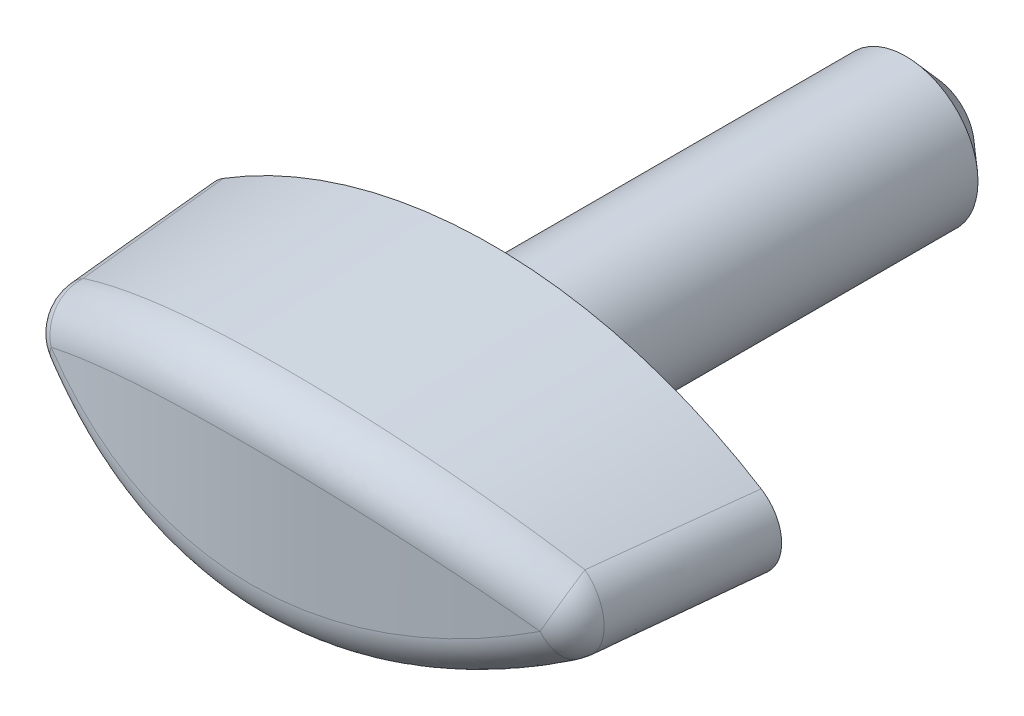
ISO-10303-21;
HEADER;
FILE_DESCRIPTION(('STEP AP214'),'2;1');
FILE_NAME('part.step','',(''),(''),'','','');
FILE_SCHEMA(('AUTOMOTIVE_DESIGN { 1 0 10303 214 1 1 1 1 }'));
ENDSEC;
DATA;
#1=APPLICATION_CONTEXT('core data for automotive mechanical design processes');
#2=APPLICATION_PROTOCOL_DEFINITION('international standard','automotive_design',2000,#1);
#3=PRODUCT_CONTEXT('',#1,'mechanical');
#4=PRODUCT('Part','Part','',(#3));
#5=PRODUCT_RELATED_PRODUCT_CATEGORY('part','',(#4));
#6=PRODUCT_DEFINITION_FORMATION('','',#4);
#7=PRODUCT_DEFINITION_CONTEXT('part definition',#1,'design');
#8=PRODUCT_DEFINITION('design','',#6,#7);
#9=PRODUCT_DEFINITION_SHAPE('','',#8);
#10=(LENGTH_UNIT() NAMED_UNIT(*) SI_UNIT(.MILLI.,.METRE.));
#11=(NAMED_UNIT(*) PLANE_ANGLE_UNIT() SI_UNIT($,.RADIAN.));
#12=(NAMED_UNIT(*) SI_UNIT($,.STERADIAN.) SOLID_ANGLE_UNIT());
#13=UNCERTAINTY_MEASURE_WITH_UNIT(LENGTH_MEASURE(1.E-05),#10,'distance_accuracy_value','');
#14=(GEOMETRIC_REPRESENTATION_CONTEXT(3) GLOBAL_UNCERTAINTY_ASSIGNED_CONTEXT((#13)) GLOBAL_UNIT_ASSIGNED_CONTEXT((#10,
#11,#12)) REPRESENTATION_CONTEXT('',''));
#15=CARTESIAN_POINT('',(0.,0.,0.));
#16=DIRECTION('',(0.,0.,1.));
#17=DIRECTION('',(1.,0.,0.));
#18=AXIS2_PLACEMENT_3D('',#15,#16,#17);
#19=CARTESIAN_POINT('',(-0.133482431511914,-27.3688144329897,0.4));
#20=DIRECTION('',(0.,0.,-1.));
#21=DIRECTION('',(1.,0.,0.));
#22=AXIS2_PLACEMENT_3D('',#19,#20,#21);
#23=CONICAL_SURFACE('',#22,35.2188144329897,0.05235987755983);
#24=CARTESIAN_POINT('',(-0.133482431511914,-27.3688144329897,0.4));
#25=DIRECTION('',(0.,0.,1.));
#26=DIRECTION('',(1.,0.,0.));
#27=AXIS2_PLACEMENT_3D('',#24,#25,#26);
#28=CIRCLE('',#27,35.2188144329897);
#29=CARTESIAN_POINT('',(18.455587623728,2.54458331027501,0.4));
#30=VERTEX_POINT('',#29);
#31=CARTESIAN_POINT('',(-18.7225524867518,2.54458331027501,0.4));
#32=VERTEX_POINT('',#31);
#33=EDGE_CURVE('E235',#30,#32,#28,.T.);
#34=ORIENTED_EDGE('',*,*,#33,.T.);
#35=CARTESIAN_POINT('',(-9.94764058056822,2.84937929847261,66.1700536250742));
#36=CARTESIAN_POINT('',(-11.9799614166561,2.17032947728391,66.5148628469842));
#37=CARTESIAN_POINT('',(-11.9799614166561,0.,66.5148628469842));
#38=CARTESIAN_POINT('',(-11.9799614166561,-2.1703294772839,66.5148628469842));
#39=CARTESIAN_POINT('',(-9.94764058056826,-2.84937929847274,66.1700536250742));
#40=CARTESIAN_POINT('',(-10.0634314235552,2.84614228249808,65.5462752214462));
#41=CARTESIAN_POINT('',(-12.0865456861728,2.1624595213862,65.8866121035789));
#42=CARTESIAN_POINT('',(-12.0866767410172,0.,65.8858334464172));
#43=CARTESIAN_POINT('',(-12.0865456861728,-2.16245952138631,65.8866121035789));
#44=CARTESIAN_POINT('',(-10.0634314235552,-2.84614228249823,65.5462752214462));
#45=CARTESIAN_POINT('',(-10.1773690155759,2.84291485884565,64.9222194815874));
#46=CARTESIAN_POINT('',(-12.1915627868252,2.15475428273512,65.2575420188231));
#47=CARTESIAN_POINT('',(-12.1916856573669,0.,65.2567934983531));
#48=CARTESIAN_POINT('',(-12.1915627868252,-2.15475428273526,65.2575420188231));
#49=CARTESIAN_POINT('',(-10.1773690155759,-2.84291485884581,64.9222194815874));
#50=CARTESIAN_POINT('',(-10.4018549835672,2.83647934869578,63.6736155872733));
#51=CARTESIAN_POINT('',(-12.3984693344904,2.13966577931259,63.9994335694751));
#52=CARTESIAN_POINT('',(-12.3985927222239,0.,63.9986847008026));
#53=CARTESIAN_POINT('',(-12.3984693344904,-2.13966577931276,63.9994335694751));
#54=CARTESIAN_POINT('',(-10.4018549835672,-2.83647934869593,63.6736155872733));
#55=CARTESIAN_POINT('',(-10.5124033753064,2.83327126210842,63.0490674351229));
#56=CARTESIAN_POINT('',(-12.5003766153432,2.13228099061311,63.3703319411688));
#57=CARTESIAN_POINT('',(-12.5004908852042,0.,63.3696158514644));
#58=CARTESIAN_POINT('',(-12.5003766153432,-2.13228099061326,63.3703319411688));
#59=CARTESIAN_POINT('',(-10.5124033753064,-2.83327126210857,63.0490674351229));
#60=CARTESIAN_POINT('',(-10.8394372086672,2.82367633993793,61.1747980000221));
#61=CARTESIAN_POINT('',(-12.8015122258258,2.1105902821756,61.4852332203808));
#62=CARTESIAN_POINT('',(-12.8019691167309,0.,61.4823746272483));
#63=CARTESIAN_POINT('',(-12.8015122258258,-2.11059028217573,61.4852332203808));
#64=CARTESIAN_POINT('',(-10.8394372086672,-2.82367633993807,61.1747980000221));
#65=CARTESIAN_POINT('',(-11.0513166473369,2.81731869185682,59.9244228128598));
#66=CARTESIAN_POINT('',(-12.9969375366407,2.09669040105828,60.2267788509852));
#67=CARTESIAN_POINT('',(-12.9973378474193,0.,60.2241384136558));
#68=CARTESIAN_POINT('',(-12.9969375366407,-2.09669040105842,60.2267788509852));
#69=CARTESIAN_POINT('',(-11.0513166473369,-2.81731869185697,59.9244228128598));
#70=CARTESIAN_POINT('',(-11.4647261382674,2.8046821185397,57.4223869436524));
#71=CARTESIAN_POINT('',(-13.3782702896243,2.06988168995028,57.7101943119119));
#72=CARTESIAN_POINT('',(-13.3786682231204,0.,57.7075667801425));
#73=CARTESIAN_POINT('',(-13.3782702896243,-2.06988168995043,57.7101943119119));
#74=CARTESIAN_POINT('',(-11.4647261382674,-2.80468211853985,57.4223869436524));
#75=CARTESIAN_POINT('',(-11.6662569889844,2.79840318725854,56.1707263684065));
#76=CARTESIAN_POINT('',(-13.5642765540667,2.05696454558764,56.4516773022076));
#77=CARTESIAN_POINT('',(-13.5646305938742,0.,56.4492313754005));
#78=CARTESIAN_POINT('',(-13.5642765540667,-2.0569645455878,56.4516773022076));
#79=CARTESIAN_POINT('',(-11.6662569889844,-2.79840318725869,56.1707263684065));
#80=CARTESIAN_POINT('',(-12.0604561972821,2.78592331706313,53.6662651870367));
#81=CARTESIAN_POINT('',(-13.9281862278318,2.03197951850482,53.9347762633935));
#82=CARTESIAN_POINT('',(-13.9285373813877,0.,53.9323448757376));
#83=CARTESIAN_POINT('',(-13.9281862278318,-2.03197951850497,53.9347762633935));
#84=CARTESIAN_POINT('',(-12.0604561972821,-2.78592331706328,53.6662651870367));
#85=CARTESIAN_POINT('',(-12.2531244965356,2.77972237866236,52.4134645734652));
#86=CARTESIAN_POINT('',(-14.1061688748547,2.01990506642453,52.6760596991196));
#87=CARTESIAN_POINT('',(-14.1064817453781,0.,52.6737937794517));
#88=CARTESIAN_POINT('',(-14.1061688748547,-2.01990506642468,52.6760596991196));
#89=CARTESIAN_POINT('',(-12.2531244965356,-2.77972237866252,52.4134645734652));
#90=CARTESIAN_POINT('',(-12.8195712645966,2.76123825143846,48.6541414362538));
#91=CARTESIAN_POINT('',(-14.6286414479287,1.98485174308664,48.9073744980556));
#92=CARTESIAN_POINT('',(-14.6299004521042,0.,48.8983113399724));
#93=CARTESIAN_POINT('',(-14.6286414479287,-1.98485174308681,48.9073744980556));
#94=CARTESIAN_POINT('',(-12.8195712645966,-2.76123825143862,48.6541414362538));
#95=CARTESIAN_POINT('',(-13.1818709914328,2.74907129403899,46.1462109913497));
#96=CARTESIAN_POINT('',(-14.963998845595,1.96287987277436,46.389071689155));
#97=CARTESIAN_POINT('',(-14.9650336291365,0.,46.3810615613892));
#98=CARTESIAN_POINT('',(-14.963998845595,-1.96287987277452,46.389071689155));
#99=CARTESIAN_POINT('',(-13.1818709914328,-2.74907129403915,46.1462109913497));
#100=CARTESIAN_POINT('',(-13.8826914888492,2.72504071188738,41.1276098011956));
#101=CARTESIAN_POINT('',(-15.6129960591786,1.92123528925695,41.353678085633));
#102=CARTESIAN_POINT('',(-15.6140160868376,0.,41.3457454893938));
#103=CARTESIAN_POINT('',(-15.6129960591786,-1.9212352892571,41.353678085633));
#104=CARTESIAN_POINT('',(-13.8826914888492,-2.72504071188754,41.1276098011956));
#105=CARTESIAN_POINT('',(-14.2212117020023,2.71317709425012,38.6169389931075));
#106=CARTESIAN_POINT('',(-15.9270018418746,1.9015334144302,38.8347968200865));
#107=CARTESIAN_POINT('',(-15.9278648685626,0.,38.8276791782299));
#108=CARTESIAN_POINT('',(-15.9270018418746,-1.90153341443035,38.8347968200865));
#109=CARTESIAN_POINT('',(-14.2212117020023,-2.71317709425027,38.6169389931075));
#110=CARTESIAN_POINT('',(-14.8789448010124,2.68974887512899,33.5943492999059));
#111=CARTESIAN_POINT('',(-16.5375019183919,1.86398835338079,33.7987360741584));
#112=CARTESIAN_POINT('',(-16.5383589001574,0.,33.7916652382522));
#113=CARTESIAN_POINT('',(-16.5375019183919,-1.86398835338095,33.7987360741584));
#114=CARTESIAN_POINT('',(-14.8789448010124,-2.68974887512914,33.5943492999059));
#115=CARTESIAN_POINT('',(-15.198163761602,2.67818418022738,31.0824310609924));
#116=CARTESIAN_POINT('',(-16.8342730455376,1.84612351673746,31.2801176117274));
#117=CARTESIAN_POINT('',(-16.8350095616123,0.,31.2737178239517));
#118=CARTESIAN_POINT('',(-16.8342730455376,-1.84612351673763,31.2801176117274));
#119=CARTESIAN_POINT('',(-15.198163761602,-2.67818418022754,31.0824310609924));
#120=CARTESIAN_POINT('',(-15.8207459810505,2.6553411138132,26.0570201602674));
#121=CARTESIAN_POINT('',(-17.4135109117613,1.81192131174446,26.2436110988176));
#122=CARTESIAN_POINT('',(-17.4142419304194,0.,26.2372505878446));
#123=CARTESIAN_POINT('',(-17.4135109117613,-1.81192131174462,26.2436110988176));
#124=CARTESIAN_POINT('',(-15.8207459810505,-2.65534111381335,26.0570201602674));
#125=CARTESIAN_POINT('',(-16.1241093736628,2.64406273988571,23.5435275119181));
#126=CARTESIAN_POINT('',(-17.6961864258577,1.79556816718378,23.7245322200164));
#127=CARTESIAN_POINT('',(-17.6968237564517,0.,23.7187307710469));
#128=CARTESIAN_POINT('',(-17.6961864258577,-1.79556816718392,23.7245322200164));
#129=CARTESIAN_POINT('',(-16.1241093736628,-2.64406273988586,23.5435275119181));
#130=CARTESIAN_POINT('',(-16.7174960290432,2.62178242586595,18.5151154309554));
#131=CARTESIAN_POINT('',(-18.2495558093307,1.76414591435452,18.6868014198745));
#132=CARTESIAN_POINT('',(-18.2501901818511,0.,18.6810256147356));
#133=CARTESIAN_POINT('',(-18.2495558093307,-1.76414591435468,18.6868014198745));
#134=CARTESIAN_POINT('',(-16.7174960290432,-2.62178242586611,18.5151154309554));
#135=CARTESIAN_POINT('',(-17.0075185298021,2.61078050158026,16.0001959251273));
#136=CARTESIAN_POINT('',(-18.5204137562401,1.74906476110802,16.1671467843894));
#137=CARTESIAN_POINT('',(-18.5209741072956,0.,16.161840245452));
#138=CARTESIAN_POINT('',(-18.5204137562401,-1.74906476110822,16.1671467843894));
#139=CARTESIAN_POINT('',(-17.007518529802,-2.61078050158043,16.0001959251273));
#140=CARTESIAN_POINT('',(-17.5761162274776,2.58904463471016,10.969297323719));
#141=CARTESIAN_POINT('',(-19.0518906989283,1.72000174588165,11.1282747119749));
#142=CARTESIAN_POINT('',(-19.0524458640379,0.,11.1230051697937));
#143=CARTESIAN_POINT('',(-19.0518906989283,-1.72000174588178,11.1282747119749));
#144=CARTESIAN_POINT('',(-17.5761162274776,-2.58904463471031,10.969297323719));
#145=CARTESIAN_POINT('',(-17.8546913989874,2.57831069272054,8.45331822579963));
#146=CARTESIAN_POINT('',(-19.3126426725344,1.70601035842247,8.60820031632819));
#147=CARTESIAN_POINT('',(-19.3131336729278,0.,8.60335546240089));
#148=CARTESIAN_POINT('',(-19.3126426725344,-1.7060103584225,8.60820031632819));
#149=CARTESIAN_POINT('',(-17.8546913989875,-2.57831069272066,8.45331822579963));
#150=CARTESIAN_POINT('',(-18.6754152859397,2.54650453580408,0.905774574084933));
#151=CARTESIAN_POINT('',(-20.0800124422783,1.66554621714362,1.06490118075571));
#152=CARTESIAN_POINT('',(-20.0819891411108,0.,1.0455066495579));
#153=CARTESIAN_POINT('',(-20.0800124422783,-1.66554621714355,1.06490118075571));
#154=CARTESIAN_POINT('',(-18.6754152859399,-2.54650453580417,0.905774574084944));
#155=CARTESIAN_POINT('',(-19.2027619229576,2.52582042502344,-4.12710669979));
#156=CARTESIAN_POINT('',(-20.5755333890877,1.64037213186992,-3.97658913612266));
#157=CARTESIAN_POINT('',(-20.5771350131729,0.,-3.9933054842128));
#158=CARTESIAN_POINT('',(-20.5755333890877,-1.64037213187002,-3.97658913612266));
#159=CARTESIAN_POINT('',(-19.2027619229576,-2.52582042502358,-4.12710669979));
#160=CARTESIAN_POINT('',(-20.2268944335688,2.4854191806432,-14.1952793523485));
#161=CARTESIAN_POINT('',(-21.5390704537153,1.59297490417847,-14.0555607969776));
#162=CARTESIAN_POINT('',(-21.5406472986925,-1.16511262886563E-13,-14.0720924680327));
#163=CARTESIAN_POINT('',(-21.5390704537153,-1.5929749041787,-14.0555607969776));
#164=CARTESIAN_POINT('',(-20.2268944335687,-2.48541918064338,-14.1952793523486));
#165=CARTESIAN_POINT('',(-20.7236810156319,2.46570202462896,-19.230570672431));
#166=CARTESIAN_POINT('',(-22.0076989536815,1.57071112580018,-19.0975815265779));
#167=CARTESIAN_POINT('',(-22.0090143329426,0.,-19.1120672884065));
#168=CARTESIAN_POINT('',(-22.0076989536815,-1.57071112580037,-19.0975815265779));
#169=CARTESIAN_POINT('',(-20.7236810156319,-2.46570202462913,-19.230570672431));
#170=CARTESIAN_POINT('',(-21.6928739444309,2.42716450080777,-29.3045674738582));
#171=CARTESIAN_POINT('',(-22.9231486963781,1.52853719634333,-29.1801362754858));
#172=CARTESIAN_POINT('',(-22.9244569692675,0.,-29.1945468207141));
#173=CARTESIAN_POINT('',(-22.9231486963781,-1.52853719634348,-29.1801362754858));
#174=CARTESIAN_POINT('',(-21.6928739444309,-2.42716450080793,-29.3045674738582));
#175=CARTESIAN_POINT('',(-22.1652730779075,2.40834439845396,-34.3432735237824));
#176=CARTESIAN_POINT('',(-23.3704165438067,1.50859917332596,-34.2242978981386));
#177=CARTESIAN_POINT('',(-23.3715262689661,0.,-34.2370518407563));
#178=CARTESIAN_POINT('',(-23.3704165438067,-1.50859917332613,-34.2242978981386));
#179=CARTESIAN_POINT('',(-22.1652730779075,-2.40834439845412,-34.3432735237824));
#180=CARTESIAN_POINT('',(-22.858760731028,2.38074702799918,-41.902509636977));
#181=CARTESIAN_POINT('',(-24.0286834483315,1.4801068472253,-41.7983357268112));
#182=CARTESIAN_POINT('',(-24.0289576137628,0.,-41.801497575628));
#183=CARTESIAN_POINT('',(-24.0286834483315,-1.48010684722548,-41.7983357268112));
#184=CARTESIAN_POINT('',(-22.858760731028,-2.38074702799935,-41.902509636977));
#185=CARTESIAN_POINT('',(-23.0874066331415,2.37165329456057,-44.42247237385));
#186=CARTESIAN_POINT('',(-24.2456523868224,1.47085913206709,-44.3201209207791));
#187=CARTESIAN_POINT('',(-24.2459077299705,0.,-44.3231153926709));
#188=CARTESIAN_POINT('',(-24.2456523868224,-1.47085913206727,-44.3201209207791));
#189=CARTESIAN_POINT('',(-23.0874066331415,-2.37165329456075,-44.42247237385));
#190=CARTESIAN_POINT('',(-23.5400779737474,2.35366995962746,-49.462737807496));
#191=CARTESIAN_POINT('',(-24.6755293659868,1.45280372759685,-49.3635662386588));
#192=CARTESIAN_POINT('',(-24.6757834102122,0.,-49.3665480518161));
#193=CARTESIAN_POINT('',(-24.6755293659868,-1.45280372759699,-49.3635662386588));
#194=CARTESIAN_POINT('',(-23.5400779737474,-2.35366995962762,-49.462737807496));
#195=CARTESIAN_POINT('',(-23.7641034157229,2.34478035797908,-51.9830405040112));
#196=CARTESIAN_POINT('',(-24.8884756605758,1.4439937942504,-51.8855627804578));
#197=CARTESIAN_POINT('',(-24.8887089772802,0.,-51.8883628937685));
#198=CARTESIAN_POINT('',(-24.8884756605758,-1.44399379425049,-51.8855627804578));
#199=CARTESIAN_POINT('',(-23.7641034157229,-2.34478035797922,-51.9830405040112));
#200=CARTESIAN_POINT('',(-23.9860278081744,2.33598938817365,-54.5034959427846));
#201=CARTESIAN_POINT('',(-25.0998062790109,1.43537470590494,-54.4102690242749));
#202=CARTESIAN_POINT('',(-25.0998062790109,0.,-54.4102690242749));
#203=CARTESIAN_POINT('',(-25.0998062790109,-1.43537470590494,-54.4102690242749));
#204=CARTESIAN_POINT('',(-23.9860278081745,-2.33598938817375,-54.5034959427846));
#205=(BOUNDED_SURFACE() B_SPLINE_SURFACE(3,2,((#35,#36,#37,#38,#39),(#40,#41,#42,#43,#44),(#45,
#46,#47,#48,#49),(#50,#51,#52,#53,#54),(#55,#56,#57,#58,#59),(#60,#61,#62,#63,#64),(#65,#66,#67,
#68,#69),(#70,#71,#72,#73,#74),(#75,#76,#77,#78,#79),(#80,#81,#82,#83,#84),(#85,#86,#87,#88,
#89),(#90,#91,#92,#93,#94),(#95,#96,#97,#98,#99),(#100,#101,#102,#103,#104),(#105,#106,#107,
#108,#109),(#110,#111,#112,#113,#114),(#115,#116,#117,#118,#119),(#120,#121,#122,#123,#124),
(#125,#126,#127,#128,#129),(#130,#131,#132,#133,#134),(#135,#136,#137,#138,#139),(#140,#141,
#142,#143,#144),(#145,#146,#147,#148,#149),(#150,#151,#152,#153,#154),(#155,#156,#157,#158,
#159),(#160,#161,#162,#163,#164),(#165,#166,#167,#168,#169),(#170,#171,#172,#173,#174),(#175,
#176,#177,#178,#179),(#180,#181,#182,#183,#184),(#185,#186,#187,#188,#189),(#190,#191,#192,#193,
#194),(#195,#196,#197,#198,#199),(#200,#201,#202,#203,#204)),.UNSPECIFIED.,.F.,.F.,
.F.) B_SPLINE_SURFACE_WITH_KNOTS((4,2,2,2,2,2,2,2,2,2,2,2,2,2,2,2,4),(3,2,3),(0.,
1.89806852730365,3.79612822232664,7.59215961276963,11.3878976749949,15.1836607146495,
22.7737107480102,30.3639386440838,37.9517650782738,45.5395274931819,53.1277227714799,
60.715934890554,75.8871979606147,91.0581091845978,106.233482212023,113.821296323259,
121.409104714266),(0.,0.5,1.),
.UNSPECIFIED.) GEOMETRIC_REPRESENTATION_ITEM() RATIONAL_B_SPLINE_SURFACE(((1.,0.810209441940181,
1.,0.810209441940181,1.),(1.,0.811220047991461,1.,0.811220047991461,1.),(1.,0.812208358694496,
1.,0.812208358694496,1.),(1.,0.814144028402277,1.,0.814144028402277,1.),(1.,0.815091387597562,
1.,0.815091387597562,1.),(1.,0.817877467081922,1.,0.817877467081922,1.),(1.,0.819660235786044,
1.,0.819660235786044,1.),(1.,0.823099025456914,1.,0.823099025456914,1.),(1.,0.824755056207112,
1.,0.824755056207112,1.),(1.,0.827957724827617,1.,0.827957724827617,1.),(1.,0.829504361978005,
1.,0.829504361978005,1.),(1.,0.834000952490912,1.,0.834000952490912,1.),(1.,0.836808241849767,
1.,0.836808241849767,1.),(1.,0.842123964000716,1.,0.842123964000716,1.),(1.,0.844632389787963,
1.,0.844632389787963,1.),(1.,0.849405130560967,1.,0.849405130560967,1.),(1.,0.85166952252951,1.,
0.85166952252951,1.),(1.,0.855995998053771,1.,0.855995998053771,1.),(1.,0.858058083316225,1.,
0.858058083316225,1.),(1.,0.86201098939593,1.,0.86201098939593,1.),(1.,0.86390180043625,1.,
0.86390180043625,1.),(1.,0.867535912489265,1.,0.867535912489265,1.),(1.,0.869279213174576,1.,
0.869279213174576,1.),(1.,0.874316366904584,1.,0.874316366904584,1.),(1.,0.877418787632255,1.,
0.877418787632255,1.),(1.,0.8832267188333,1.,0.8832267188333,1.),(1.,0.885932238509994,1.,
0.885932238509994,1.),(1.,0.89102494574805,1.,0.89102494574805,1.),(1.,0.893412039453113,1.,
0.893412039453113,1.),(1.,0.896796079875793,1.,0.896796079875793,1.),(1.,0.897891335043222,1.,
0.897891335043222,1.),(1.,0.900021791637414,1.,0.900021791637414,1.),(1.,0.901056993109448,1.,
0.901056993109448,1.),(1.,0.902064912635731,1.,0.902064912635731,1.))) REPRESENTATION_ITEM('') SURFACE());
#206=CARTESIAN_POINT('',(-23.9860278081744,2.33598938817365,-54.5034959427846));
#207=CARTESIAN_POINT('',(-23.7641034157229,2.34478035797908,-51.9830405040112));
#208=CARTESIAN_POINT('',(-23.5400779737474,2.35366995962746,-49.462737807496));
#209=CARTESIAN_POINT('',(-23.0874066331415,2.37165329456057,-44.42247237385));
#210=CARTESIAN_POINT('',(-22.858760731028,2.38074702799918,-41.902509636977));
#211=CARTESIAN_POINT('',(-22.1652730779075,2.40834439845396,-34.3432735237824));
#212=CARTESIAN_POINT('',(-21.6928739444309,2.42716450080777,-29.3045674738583));
#213=CARTESIAN_POINT('',(-20.7236810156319,2.46570202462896,-19.230570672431));
#214=CARTESIAN_POINT('',(-20.2268944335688,2.4854191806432,-14.1952793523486));
#215=CARTESIAN_POINT('',(-19.2027619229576,2.52582042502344,-4.12710669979));
#216=CARTESIAN_POINT('',(-18.6754152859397,2.54650453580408,0.90577457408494));
#217=CARTESIAN_POINT('',(-17.8546913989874,2.57831069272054,8.45331822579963));
#218=CARTESIAN_POINT('',(-17.5761162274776,2.58904463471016,10.969297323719));
#219=CARTESIAN_POINT('',(-17.0075185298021,2.61078050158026,16.0001959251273));
#220=CARTESIAN_POINT('',(-16.7174960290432,2.62178242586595,18.5151154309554));
#221=CARTESIAN_POINT('',(-16.1241093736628,2.64406273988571,23.5435275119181));
#222=CARTESIAN_POINT('',(-15.8207459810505,2.6553411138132,26.0570201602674));
#223=CARTESIAN_POINT('',(-15.198163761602,2.67818418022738,31.0824310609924));
#224=CARTESIAN_POINT('',(-14.8789448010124,2.68974887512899,33.5943492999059));
#225=CARTESIAN_POINT('',(-14.2212117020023,2.71317709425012,38.6169389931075));
#226=CARTESIAN_POINT('',(-13.8826914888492,2.72504071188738,41.1276098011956));
#227=CARTESIAN_POINT('',(-13.1818709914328,2.74907129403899,46.1462109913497));
#228=CARTESIAN_POINT('',(-12.8195712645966,2.76123825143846,48.6541414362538));
#229=CARTESIAN_POINT('',(-12.2531244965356,2.77972237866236,52.4134645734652));
#230=CARTESIAN_POINT('',(-12.0604561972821,2.78592331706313,53.6662651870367));
#231=CARTESIAN_POINT('',(-11.6662569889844,2.79840318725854,56.1707263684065));
#232=CARTESIAN_POINT('',(-11.4647261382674,2.8046821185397,57.4223869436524));
#233=CARTESIAN_POINT('',(-11.0513166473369,2.81731869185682,59.9244228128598));
#234=CARTESIAN_POINT('',(-10.8394372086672,2.82367633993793,61.1747980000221));
#235=CARTESIAN_POINT('',(-10.5124033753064,2.83327126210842,63.0490674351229));
#236=CARTESIAN_POINT('',(-10.4018549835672,2.83647934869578,63.6736155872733));
#237=CARTESIAN_POINT('',(-10.1773690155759,2.84291485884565,64.9222194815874));
#238=CARTESIAN_POINT('',(-10.0634314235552,2.84614228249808,65.5462752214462));
#239=CARTESIAN_POINT('',(-9.94764058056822,2.84937929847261,66.1700536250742));
#240=B_SPLINE_CURVE_WITH_KNOTS('',3,(#206,#207,#208,#209,#210,#211,#212,#213,#214,#215,#216,
#217,#218,#219,#220,#221,#222,#223,#224,#225,#226,#227,#228,#229,#230,#231,#232,#233,#234,#235,
#236,#237,#238,#239),.UNSPECIFIED.,.F.,.F.,(4,2,2,2,2,2,2,2,2,2,2,2,2,2,2,2,4),(0.,
7.58780839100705,15.1756225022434,30.3509955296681,45.5219067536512,60.6931698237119,
68.281381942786,75.869577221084,83.4573396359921,91.0451660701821,98.6353939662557,
106.225443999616,110.021207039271,113.816945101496,117.612976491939,119.511036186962,
121.409104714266),.UNSPECIFIED.);
#241=CARTESIAN_POINT('',(-17.5390517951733,2.5904405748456,11.2843807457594));
#242=VERTEX_POINT('',#241);
#243=EDGE_CURVE('E185',#32,#242,#240,.T.);
#244=ORIENTED_EDGE('',*,*,#243,.T.);
#245=CARTESIAN_POINT('',(-25.9116063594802,-6.5678676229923,9.45201347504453));
#246=CARTESIAN_POINT('',(-26.9623977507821,-5.22396085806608,8.77235175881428));
#247=CARTESIAN_POINT('',(-26.5522012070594,-4.61264985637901,7.09002431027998));
#248=CARTESIAN_POINT('',(-25.5819169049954,-6.22525334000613,9.66526230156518));
#249=CARTESIAN_POINT('',(-26.6372434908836,-4.84810499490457,8.99498365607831));
#250=CARTESIAN_POINT('',(-26.2149522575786,-4.23718862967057,7.28986126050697));
#251=CARTESIAN_POINT('',(-25.2442057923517,-5.8891721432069,9.8779192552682));
#252=CARTESIAN_POINT('',(-26.3045832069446,-4.4797963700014,9.21680138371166));
#253=CARTESIAN_POINT('',(-25.8694494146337,-3.86884377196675,7.48914356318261));
#254=CARTESIAN_POINT('',(-24.5528591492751,-5.23032017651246,10.3008712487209));
#255=CARTESIAN_POINT('',(-25.6221477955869,-3.75580524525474,9.65919199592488));
#256=CARTESIAN_POINT('',(-25.1620506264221,-3.14666241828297,7.88549480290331));
#257=CARTESIAN_POINT('',(-24.1992229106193,-4.90754999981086,10.5111661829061));
#258=CARTESIAN_POINT('',(-25.2722052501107,-3.40016897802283,9.87978368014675));
#259=CARTESIAN_POINT('',(-24.800153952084,-2.79282656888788,8.08256364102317));
#260=CARTESIAN_POINT('',(-23.1139686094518,-3.95902178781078,11.13710505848));
#261=CARTESIAN_POINT('',(-24.1918677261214,-2.3481514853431,10.5407319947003));
#262=CARTESIAN_POINT('',(-23.6893939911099,-1.75289230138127,8.6691352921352));
#263=CARTESIAN_POINT('',(-22.3586268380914,-3.35369283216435,11.5473966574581));
#264=CARTESIAN_POINT('',(-23.4385749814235,-1.67552627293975,10.9749701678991));
#265=CARTESIAN_POINT('',(-22.9160968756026,-1.08907596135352,9.05362238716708));
#266=CARTESIAN_POINT('',(-20.7818551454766,-2.19765537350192,12.346700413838));
#267=CARTESIAN_POINT('',(-21.8579618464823,-0.382152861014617,11.82673286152));
#268=CARTESIAN_POINT('',(-21.3014107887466,0.178913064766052,9.80265546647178));
#269=CARTESIAN_POINT('',(-19.9600203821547,-1.64733547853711,12.7355535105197));
#270=CARTESIAN_POINT('',(-21.029239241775,0.237229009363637,12.2437476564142));
#271=CARTESIAN_POINT('',(-20.4596044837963,0.782661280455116,10.1670523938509));
#272=CARTESIAN_POINT('',(-18.2575571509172,-0.610848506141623,13.4796245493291));
#273=CARTESIAN_POINT('',(-19.302109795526,1.41287325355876,13.0479460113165));
#274=CARTESIAN_POINT('',(-18.715340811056,1.91998638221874,10.8643265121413));
#275=CARTESIAN_POINT('',(-17.3769597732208,-0.124647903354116,13.834860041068));
#276=CARTESIAN_POINT('',(-18.4031396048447,1.96785628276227,13.4344551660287));
#277=CARTESIAN_POINT('',(-17.8129155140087,2.45359993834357,11.1972201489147));
#278=CARTESIAN_POINT('',(-15.7351261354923,0.691442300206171,14.4386374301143));
#279=CARTESIAN_POINT('',(-16.7179486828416,2.90601325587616,14.0960791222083));
#280=CARTESIAN_POINT('',(-16.1300201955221,3.34941894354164,11.7630241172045));
#281=CARTESIAN_POINT('',(-14.9834257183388,1.03342158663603,14.6945703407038));
#282=CARTESIAN_POINT('',(-15.9413192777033,3.3018014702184,14.3784810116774));
#283=CARTESIAN_POINT('',(-15.3593923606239,3.72486502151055,12.002860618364));
#284=CARTESIAN_POINT('',(-13.4470034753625,1.66864621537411,15.1740241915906));
#285=CARTESIAN_POINT('',(-14.3447208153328,4.04212002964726,14.9112368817));
#286=CARTESIAN_POINT('',(-13.7840433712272,4.42233580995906,12.4521601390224));
#287=CARTESIAN_POINT('',(-12.6622879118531,1.96190074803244,15.3975512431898));
#288=CARTESIAN_POINT('',(-13.5251739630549,4.38565861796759,15.1609311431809));
#289=CARTESIAN_POINT('',(-12.9793286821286,4.74437059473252,12.6616288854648));
#290=CARTESIAN_POINT('',(-11.0663718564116,2.49543766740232,15.8071244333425));
#291=CARTESIAN_POINT('',(-11.8487521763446,5.0150093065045,15.6216067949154));
#292=CARTESIAN_POINT('',(-11.3425277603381,5.33032755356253,13.0454427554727));
#293=CARTESIAN_POINT('',(-10.255274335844,2.73590291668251,15.993299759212));
#294=CARTESIAN_POINT('',(-10.9928496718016,5.29998469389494,15.8319990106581));
#295=CARTESIAN_POINT('',(-10.5105478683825,5.59445033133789,13.2199089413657));
#296=CARTESIAN_POINT('',(-8.6088043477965,3.16197518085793,16.3252089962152));
#297=CARTESIAN_POINT('',(-9.24591509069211,5.80822566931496,16.2094862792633));
#298=CARTESIAN_POINT('',(-8.82151313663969,6.06247820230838,13.5309433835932));
#299=CARTESIAN_POINT('',(-7.77343736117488,3.34759447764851,16.4709519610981));
#300=CARTESIAN_POINT('',(-8.35623326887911,6.03049926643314,16.375865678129));
#301=CARTESIAN_POINT('',(-7.96446395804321,6.26639677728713,13.6675201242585));
#302=CARTESIAN_POINT('',(-6.30456128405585,3.62036059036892,16.6864405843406));
#303=CARTESIAN_POINT('',(-6.78569450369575,6.35873278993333,16.6229913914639));
#304=CARTESIAN_POINT('',(-6.45734742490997,6.56607248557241,13.8694560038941));
#305=CARTESIAN_POINT('',(-5.67521841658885,3.7205637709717,16.7660933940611));
#306=CARTESIAN_POINT('',(-6.11075264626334,6.47970396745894,16.7146060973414));
#307=CARTESIAN_POINT('',(-5.81158450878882,6.67616820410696,13.9440992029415));
#308=CARTESIAN_POINT('',(-4.40886396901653,3.88868776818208,16.9005531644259));
#309=CARTESIAN_POINT('',(-4.74888712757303,6.68337557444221,16.8697106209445));
#310=CARTESIAN_POINT('',(-4.51213654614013,6.86089822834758,14.0701023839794));
#311=CARTESIAN_POINT('',(-3.77185121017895,3.95660355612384,16.9553562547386));
#312=CARTESIAN_POINT('',(-4.06281663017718,6.76579746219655,16.9329921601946));
#313=CARTESIAN_POINT('',(-3.85845028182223,6.93552701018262,14.1214587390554));
#314=CARTESIAN_POINT('',(-2.49262969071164,4.0595240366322,17.0393945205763));
#315=CARTESIAN_POINT('',(-2.6822628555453,6.89108237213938,17.0301954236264));
#316=CARTESIAN_POINT('',(-2.54571236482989,7.04862641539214,14.2002115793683));
#317=CARTESIAN_POINT('',(-1.85041735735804,4.09450374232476,17.0686102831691));
#318=CARTESIAN_POINT('',(-1.98872288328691,6.93373781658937,17.063960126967));
#319=CARTESIAN_POINT('',(-1.88665702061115,7.08706958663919,14.2275898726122));
#320=CARTESIAN_POINT('',(-0.564408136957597,4.13112920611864,17.1010243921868));
#321=CARTESIAN_POINT('',(-0.598226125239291,6.97862079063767,17.1013373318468));
#322=CARTESIAN_POINT('',(-0.566907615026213,7.12733004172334,14.2579653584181));
#323=CARTESIAN_POINT('',(0.0793884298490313,4.13278122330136,17.1042276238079));
#324=CARTESIAN_POINT('',(0.0977321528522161,6.98078942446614,17.1049030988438));
#325=CARTESIAN_POINT('',(0.0937861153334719,7.12915420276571,14.2609671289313));
#326=CARTESIAN_POINT('',(1.57701571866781,4.09777629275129,17.0813510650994));
#327=CARTESIAN_POINT('',(1.71713036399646,6.93858223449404,17.0779434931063));
#328=CARTESIAN_POINT('',(1.63071048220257,7.09071283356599,14.2395293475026));
#329=CARTESIAN_POINT('',(2.43040750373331,4.048363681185,17.0453117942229));
#330=CARTESIAN_POINT('',(2.63838773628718,6.87879894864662,17.035916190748));
#331=CARTESIAN_POINT('',(2.50648743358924,7.03643179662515,14.2057566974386));
#332=CARTESIAN_POINT('',(4.12803164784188,3.89140741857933,16.9281394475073));
#333=CARTESIAN_POINT('',(4.46966477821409,6.68874417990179,16.8996130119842));
#334=CARTESIAN_POINT('',(4.24857850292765,6.86400449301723,14.0959536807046));
#335=CARTESIAN_POINT('',(4.97226212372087,3.78385203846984,16.846997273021));
#336=CARTESIAN_POINT('',(5.37748567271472,6.5589210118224,16.8056638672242));
#337=CARTESIAN_POINT('',(5.11489067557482,6.74584534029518,14.0199147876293));
#338=CARTESIAN_POINT('',(6.64527404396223,3.51223605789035,16.6415410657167));
#339=CARTESIAN_POINT('',(7.17264885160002,6.23160893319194,16.5683895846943));
#340=CARTESIAN_POINT('',(6.83155366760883,6.44746416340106,13.8273803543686));
#341=CARTESIAN_POINT('',(7.47404940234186,3.34815367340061,16.5172103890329));
#342=CARTESIAN_POINT('',(8.05810540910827,6.03483393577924,16.4255836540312));
#343=CARTESIAN_POINT('',(7.68189820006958,6.26721821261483,13.7108692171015));
#344=CARTESIAN_POINT('',(9.10997409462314,2.96588856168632,16.228232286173));
#345=CARTESIAN_POINT('',(9.80010659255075,5.57782829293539,16.0948656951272));
#346=CARTESIAN_POINT('',(9.36024997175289,5.84732885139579,13.440065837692));
#347=CARTESIAN_POINT('',(9.91712421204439,2.74770779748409,16.0635863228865));
#348=CARTESIAN_POINT('',(10.6551942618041,5.31851951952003,15.9076146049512));
#349=CARTESIAN_POINT('',(10.1882580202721,5.60768759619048,13.2857749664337));
#350=CARTESIAN_POINT('',(11.5001483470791,2.26158364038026,15.698605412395));
#351=CARTESIAN_POINT('',(12.325250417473,4.74312513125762,15.4943867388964));
#352=CARTESIAN_POINT('',(11.8120079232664,5.07380137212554,12.9437488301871));
#353=CARTESIAN_POINT('',(12.2761816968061,1.99394845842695,15.498491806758));
#354=CARTESIAN_POINT('',(13.1393982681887,4.42838600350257,15.2693460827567));
#355=CARTESIAN_POINT('',(12.6079143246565,4.77989460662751,12.7562209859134));
#356=CARTESIAN_POINT('',(13.7982069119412,1.41110283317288,15.0658337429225));
#357=CARTESIAN_POINT('',(14.7286390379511,3.74621355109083,14.785275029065));
#358=CARTESIAN_POINT('',(14.1687093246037,4.13991192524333,12.3507741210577));
#359=CARTESIAN_POINT('',(14.5441984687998,1.09589190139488,14.8332889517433));
#360=CARTESIAN_POINT('',(15.5031761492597,3.37973795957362,14.5268890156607));
#361=CARTESIAN_POINT('',(14.9335976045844,3.79383547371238,12.1328547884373));
#362=CARTESIAN_POINT('',(16.0041198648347,0.420489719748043,14.3396389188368));
#363=CARTESIAN_POINT('',(17.011391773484,2.59848218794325,13.9813573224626));
#364=CARTESIAN_POINT('',(16.4302731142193,3.05239823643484,11.6702519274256));
#365=CARTESIAN_POINT('',(16.7180038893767,0.0602368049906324,14.0784945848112));
#366=CARTESIAN_POINT('',(17.744838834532,2.1845075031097,13.6947250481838));
#367=CARTESIAN_POINT('',(17.1620130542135,2.65696988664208,11.4255317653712));
#368=CARTESIAN_POINT('',(18.1103887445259,-0.702021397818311,13.5322812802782));
#369=CARTESIAN_POINT('',(19.1681779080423,1.31310015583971,13.0985006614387));
#370=CARTESIAN_POINT('',(18.5889836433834,1.82040931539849,10.9136714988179));
#371=CARTESIAN_POINT('',(18.7888850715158,-1.10403198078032,13.2472092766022));
#372=CARTESIAN_POINT('',(19.858181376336,0.856413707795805,12.7893404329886));
#373=CARTESIAN_POINT('',(19.2842096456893,1.37927129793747,10.6465285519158));
#374=CARTESIAN_POINT('',(20.180050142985,-1.99270985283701,12.6257896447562));
#375=CARTESIAN_POINT('',(21.2651061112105,-0.147392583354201,12.1194752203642));
#376=CARTESIAN_POINT('',(20.7094147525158,0.40425646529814,10.0641919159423));
#377=CARTESIAN_POINT('',(20.8884918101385,-2.48383094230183,12.2872296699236));
#378=CARTESIAN_POINT('',(21.9783423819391,-0.698893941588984,11.7567128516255));
#379=CARTESIAN_POINT('',(21.4350342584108,-0.134490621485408,9.74692502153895));
#380=CARTESIAN_POINT('',(22.2581097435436,-3.51104785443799,11.5924805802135));
#381=CARTESIAN_POINT('',(23.3501431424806,-1.84635337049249,11.0165060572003));
#382=CARTESIAN_POINT('',(22.8375560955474,-1.26110529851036,9.09587084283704));
#383=CARTESIAN_POINT('',(22.9192773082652,-4.04715191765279,11.2362882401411));
#384=CARTESIAN_POINT('',(24.0094060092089,-2.44172722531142,10.6392571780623));
#385=CARTESIAN_POINT('',(23.5144494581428,-1.84898188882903,8.76208053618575));
#386=CARTESIAN_POINT('',(24.1901225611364,-5.15942046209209,10.5143171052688));
#387=CARTESIAN_POINT('',(25.2705873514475,-3.67100849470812,9.87861765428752));
#388=CARTESIAN_POINT('',(24.8152229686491,-3.06842039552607,8.08551639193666));
#389=CARTESIAN_POINT('',(24.8000152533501,-5.73539707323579,10.14858773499));
#390=CARTESIAN_POINT('',(25.8735557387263,-4.30432956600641,9.49528806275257));
#391=CARTESIAN_POINT('',(25.4393245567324,-3.69977737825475,7.74278887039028));
#392=CARTESIAN_POINT('',(25.6774596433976,-6.62935820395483,9.59687294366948));
#393=CARTESIAN_POINT('',(26.7399086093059,-5.28595217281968,8.91806966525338));
#394=CARTESIAN_POINT('',(26.3369990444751,-4.67949322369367,7.22577312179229));
#395=CARTESIAN_POINT('',(25.9636668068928,-6.93229487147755,9.41247698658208));
#396=CARTESIAN_POINT('',(27.0211487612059,-5.61684324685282,8.72617592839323));
#397=CARTESIAN_POINT('',(26.6297680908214,-5.01145740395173,7.05297439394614));
#398=CARTESIAN_POINT('',(26.5235329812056,-7.54808714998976,9.04349060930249));
#399=CARTESIAN_POINT('',(27.5702389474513,-6.28804341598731,8.34306309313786));
#400=CARTESIAN_POINT('',(27.2024007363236,-5.68618709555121,6.7071947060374));
#401=CARTESIAN_POINT('',(26.7971919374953,-7.86094280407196,8.85890018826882));
#402=CARTESIAN_POINT('',(27.8382072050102,-6.62834466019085,8.15181272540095));
#403=CARTESIAN_POINT('',(27.482264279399,-6.02895265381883,6.53421374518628));
#404=CARTESIAN_POINT('',(27.0645147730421,-8.17870433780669,8.67464549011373));
#405=CARTESIAN_POINT('',(28.1002567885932,-6.97430695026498,7.96076026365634));
#406=CARTESIAN_POINT('',(27.7556144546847,-6.37705778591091,6.36154739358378));
#407=(BOUNDED_SURFACE() B_SPLINE_SURFACE(3,2,((#245,#246,#247),(#248,#249,#250),(#251,#252,
#253),(#254,#255,#256),(#257,#258,#259),(#260,#261,#262),(#263,#264,#265),(#266,#267,#268),
(#269,#270,#271),(#272,#273,#274),(#275,#276,#277),(#278,#279,#280),(#281,#282,#283),(#284,#285,
#286),(#287,#288,#289),(#290,#291,#292),(#293,#294,#295),(#296,#297,#298),(#299,#300,#301),
(#302,#303,#304),(#305,#306,#307),(#308,#309,#310),(#311,#312,#313),(#314,#315,#316),(#317,#318,
#319),(#320,#321,#322),(#323,#324,#325),(#326,#327,#328),(#329,#330,#331),(#332,#333,#334),
(#335,#336,#337),(#338,#339,#340),(#341,#342,#343),(#344,#345,#346),(#347,#348,#349),(#350,#351,
#352),(#353,#354,#355),(#356,#357,#358),(#359,#360,#361),(#362,#363,#364),(#365,#366,#367),
(#368,#369,#370),(#371,#372,#373),(#374,#375,#376),(#377,#378,#379),(#380,#381,#382),(#383,#384,
#385),(#386,#387,#388),(#389,#390,#391),(#392,#393,#394),(#395,#396,#397),(#398,#399,#400),
(#401,#402,#403),(#404,#405,#406)),.UNSPECIFIED.,.F.,.F.,.F.) B_SPLINE_SURFACE_WITH_KNOTS((4,2,
2,2,2,2,2,2,2,2,2,2,2,2,2,2,2,2,2,2,2,2,2,2,2,2,4),(3,3),(0.,1.50808420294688,3.01623553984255,
6.03538065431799,9.07453624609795,12.1120964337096,14.5665723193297,17.0205847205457,
19.4659573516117,21.9107819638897,23.7180809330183,25.5256612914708,27.334611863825,
29.1432227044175,31.5456360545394,33.9485342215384,36.3523594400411,38.7560974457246,
41.1453313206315,43.5345897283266,45.9271557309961,48.320025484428,50.9714043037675,
53.6232699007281,56.2633947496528,57.5830442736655,58.9026995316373),(0.,1.),
.UNSPECIFIED.) GEOMETRIC_REPRESENTATION_ITEM() RATIONAL_B_SPLINE_SURFACE(((1.,0.852899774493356,
1.),(1.,0.849934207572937,1.),(1.,0.846933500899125,1.),(1.,0.840878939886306,1.),(1.,
0.837825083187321,1.),(1.,0.82860410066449,1.),(1.,0.822383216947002,1.),(1.,0.809927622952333,
1.),(1.,0.803693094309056,1.),(1.,0.791454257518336,1.),(1.,0.785449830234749,1.),(1.,
0.775008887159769,1.),(1.,0.770492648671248,1.),(1.,0.761892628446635,1.),(1.,0.757808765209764,
1.),(1.,0.750222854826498,1.),(1.,0.746718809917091,1.),(1.,0.740406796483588,1.),(1.,
0.737598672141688,1.),(1.,0.733419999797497,1.),(1.,0.731865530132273,1.),(1.,0.7292361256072,
1.),(1.,0.728161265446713,1.),(1.,0.726518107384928,1.),(1.,0.725950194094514,1.),(1.,
0.725336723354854,1.),(1.,0.72529106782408,1.),(1.,0.725794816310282,1.),(1.,0.726544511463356,
1.),(1.,0.728935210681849,1.),(1.,0.730576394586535,1.),(1.,0.734678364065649,1.),(1.,
0.737139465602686,1.),(1.,0.742779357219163,1.),(1.,0.745958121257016,1.),(1.,0.752892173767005,
1.),(1.,0.756643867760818,1.),(1.,0.764611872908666,1.),(1.,0.768828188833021,1.),(1.,
0.777606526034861,1.),(1.,0.782169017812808,1.),(1.,0.791516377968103,1.),(1.,0.796301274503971,
1.),(1.,0.80650787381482,1.),(1.,0.811942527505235,1.),(1.,0.822820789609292,1.),(1.,
0.828264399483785,1.),(1.,0.839022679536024,1.),(1.,0.844337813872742,1.),(1.,0.852156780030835,
1.),(1.,0.854737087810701,1.),(1.,0.859836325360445,1.),(1.,0.862355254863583,1.),(1.,
0.864838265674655,1.))) REPRESENTATION_ITEM('') SURFACE());
#408=CARTESIAN_POINT('',(-26.5522012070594,-4.61264985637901,7.09002431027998));
#409=CARTESIAN_POINT('',(-26.2149522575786,-4.23718862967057,7.28986126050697));
#410=CARTESIAN_POINT('',(-25.8694494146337,-3.86884377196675,7.48914356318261));
#411=CARTESIAN_POINT('',(-25.1620506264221,-3.14666241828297,7.88549480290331));
#412=CARTESIAN_POINT('',(-24.800153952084,-2.79282656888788,8.08256364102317));
#413=CARTESIAN_POINT('',(-23.6893939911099,-1.75289230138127,8.6691352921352));
#414=CARTESIAN_POINT('',(-22.9160968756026,-1.08907596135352,9.05362238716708));
#415=CARTESIAN_POINT('',(-21.3014107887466,0.178913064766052,9.80265546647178));
#416=CARTESIAN_POINT('',(-20.4596044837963,0.782661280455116,10.1670523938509));
#417=CARTESIAN_POINT('',(-18.715340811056,1.91998638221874,10.8643265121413));
#418=CARTESIAN_POINT('',(-17.8129155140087,2.45359993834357,11.1972201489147));
#419=CARTESIAN_POINT('',(-16.1300201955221,3.34941894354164,11.7630241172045));
#420=CARTESIAN_POINT('',(-15.3593923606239,3.72486502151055,12.002860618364));
#421=CARTESIAN_POINT('',(-13.7840433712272,4.42233580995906,12.4521601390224));
#422=CARTESIAN_POINT('',(-12.9793286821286,4.74437059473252,12.6616288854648));
#423=CARTESIAN_POINT('',(-11.3425277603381,5.33032755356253,13.0454427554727));
#424=CARTESIAN_POINT('',(-10.5105478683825,5.59445033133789,13.2199089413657));
#425=CARTESIAN_POINT('',(-8.82151313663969,6.06247820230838,13.5309433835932));
#426=CARTESIAN_POINT('',(-7.96446395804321,6.26639677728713,13.6675201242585));
#427=CARTESIAN_POINT('',(-6.45734742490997,6.56607248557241,13.8694560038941));
#428=CARTESIAN_POINT('',(-5.81158450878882,6.67616820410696,13.9440992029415));
#429=CARTESIAN_POINT('',(-4.51213654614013,6.86089822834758,14.0701023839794));
#430=CARTESIAN_POINT('',(-3.85845028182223,6.93552701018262,14.1214587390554));
#431=CARTESIAN_POINT('',(-2.54571236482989,7.04862641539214,14.2002115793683));
#432=CARTESIAN_POINT('',(-1.88665702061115,7.08706958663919,14.2275898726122));
#433=CARTESIAN_POINT('',(-0.566907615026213,7.12733004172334,14.2579653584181));
#434=CARTESIAN_POINT('',(0.0937861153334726,7.12915420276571,14.2609671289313));
#435=CARTESIAN_POINT('',(1.63071048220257,7.09071283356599,14.2395293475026));
#436=CARTESIAN_POINT('',(2.50648743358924,7.03643179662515,14.2057566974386));
#437=CARTESIAN_POINT('',(4.24857850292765,6.86400449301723,14.0959536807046));
#438=CARTESIAN_POINT('',(5.11489067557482,6.74584534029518,14.0199147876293));
#439=CARTESIAN_POINT('',(6.83155366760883,6.44746416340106,13.8273803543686));
#440=CARTESIAN_POINT('',(7.68189820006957,6.26721821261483,13.7108692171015));
#441=CARTESIAN_POINT('',(9.36024997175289,5.84732885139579,13.440065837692));
#442=CARTESIAN_POINT('',(10.1882580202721,5.60768759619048,13.2857749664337));
#443=CARTESIAN_POINT('',(11.8120079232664,5.07380137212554,12.9437488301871));
#444=CARTESIAN_POINT('',(12.6079143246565,4.77989460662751,12.7562209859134));
#445=CARTESIAN_POINT('',(14.1687093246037,4.13991192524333,12.3507741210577));
#446=CARTESIAN_POINT('',(14.9335976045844,3.79383547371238,12.1328547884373));
#447=CARTESIAN_POINT('',(16.4302731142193,3.05239823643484,11.6702519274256));
#448=CARTESIAN_POINT('',(17.1620130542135,2.65696988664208,11.4255317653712));
#449=CARTESIAN_POINT('',(18.5889836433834,1.82040931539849,10.9136714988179));
#450=CARTESIAN_POINT('',(19.2842096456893,1.37927129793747,10.6465285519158));
#451=CARTESIAN_POINT('',(20.7094147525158,0.404256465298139,10.0641919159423));
#452=CARTESIAN_POINT('',(21.4350342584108,-0.134490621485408,9.74692502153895));
#453=CARTESIAN_POINT('',(22.8375560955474,-1.26110529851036,9.09587084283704));
#454=CARTESIAN_POINT('',(23.5144494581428,-1.84898188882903,8.76208053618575));
#455=CARTESIAN_POINT('',(24.8152229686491,-3.06842039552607,8.08551639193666));
#456=CARTESIAN_POINT('',(25.4393245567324,-3.69977737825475,7.74278887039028));
#457=CARTESIAN_POINT('',(26.3369990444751,-4.67949322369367,7.22577312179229));
#458=CARTESIAN_POINT('',(26.6297680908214,-5.01145740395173,7.05297439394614));
#459=CARTESIAN_POINT('',(27.2024007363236,-5.68618709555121,6.7071947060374));
#460=CARTESIAN_POINT('',(27.482264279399,-6.02895265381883,6.53421374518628));
#461=CARTESIAN_POINT('',(27.7556144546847,-6.37705778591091,6.36154739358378));
#462=B_SPLINE_CURVE_WITH_KNOTS('',3,(#408,#409,#410,#411,#412,#413,#414,#415,#416,#417,#418,
#419,#420,#421,#422,#423,#424,#425,#426,#427,#428,#429,#430,#431,#432,#433,#434,#435,#436,#437,
#438,#439,#440,#441,#442,#443,#444,#445,#446,#447,#448,#449,#450,#451,#452,#453,#454,#455,#456,
#457,#458,#459,#460,#461),.UNSPECIFIED.,.F.,.F.,(4,2,2,2,2,2,2,2,2,2,2,2,2,2,2,2,2,2,2,2,2,2,2,
2,2,2,4),(0.,1.50808420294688,3.01623553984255,6.03538065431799,9.07453624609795,
12.1120964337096,14.5665723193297,17.0205847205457,19.4659573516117,21.9107819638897,
23.7180809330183,25.5256612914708,27.334611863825,29.1432227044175,31.5456360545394,
33.9485342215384,36.3523594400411,38.7560974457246,41.1453313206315,43.5345897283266,
45.9271557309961,48.320025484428,50.9714043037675,53.6232699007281,56.2633947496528,
57.5830442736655,58.9026995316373),.UNSPECIFIED.);
#463=CARTESIAN_POINT('',(17.2607608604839,2.59087539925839,11.3857437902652));
#464=VERTEX_POINT('',#463);
#465=EDGE_CURVE('E72',#242,#464,#462,.T.);
#466=ORIENTED_EDGE('',*,*,#465,.T.);
#467=CARTESIAN_POINT('',(9.66971649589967,-2.84968552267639,66.2290571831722));
#468=CARTESIAN_POINT('',(11.7028962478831,-2.17107541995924,66.5743641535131));
#469=CARTESIAN_POINT('',(11.7028962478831,0.,66.5743641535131));
#470=CARTESIAN_POINT('',(11.7028962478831,2.17107541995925,66.5743641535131));
#471=CARTESIAN_POINT('',(9.66971649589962,2.84968552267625,66.2290571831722));
#472=CARTESIAN_POINT('',(9.78561316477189,-2.84644824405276,65.6053622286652));
#473=CARTESIAN_POINT('',(11.8095777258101,-2.16319517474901,65.9461812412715));
#474=CARTESIAN_POINT('',(11.8097090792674,0.,65.9454015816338));
#475=CARTESIAN_POINT('',(11.8095777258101,2.16319517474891,65.9461812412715));
#476=CARTESIAN_POINT('',(9.78561316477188,2.84644824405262,65.6053622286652));
#477=CARTESIAN_POINT('',(9.89965101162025,-2.84322055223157,64.9813888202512));
#478=CARTESIAN_POINT('',(11.9146870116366,-2.15548013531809,65.3171781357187));
#479=CARTESIAN_POINT('',(11.9148101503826,0.,65.3164286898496));
#480=CARTESIAN_POINT('',(11.9146870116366,2.15548013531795,65.3171781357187));
#481=CARTESIAN_POINT('',(9.89965101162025,2.84322055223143,64.9813888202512));
#482=CARTESIAN_POINT('',(10.1243278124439,-2.83678449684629,63.7329477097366));
#483=CARTESIAN_POINT('',(12.1217686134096,-2.14037293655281,64.0592041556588));
#484=CARTESIAN_POINT('',(12.121892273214,0.,64.0584543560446));
#485=CARTESIAN_POINT('',(12.1217686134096,2.14037293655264,64.0592041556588));
#486=CARTESIAN_POINT('',(10.1243278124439,2.83678449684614,63.7329477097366));
#487=CARTESIAN_POINT('',(10.2349667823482,-2.83357613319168,63.1084800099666));
#488=CARTESIAN_POINT('',(12.2237588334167,-2.13297924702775,63.4301698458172));
#489=CARTESIAN_POINT('',(12.2238733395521,0.,63.4294529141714));
#490=CARTESIAN_POINT('',(12.2237588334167,2.13297924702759,63.4301698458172));
#491=CARTESIAN_POINT('',(10.2349667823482,2.83357613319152,63.1084800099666));
#492=CARTESIAN_POINT('',(10.5622600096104,-2.82398037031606,61.2344497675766));
#493=CARTESIAN_POINT('',(12.5251307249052,-2.11126305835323,61.5452763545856));
#494=CARTESIAN_POINT('',(12.5255885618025,0.,61.5424144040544));
#495=CARTESIAN_POINT('',(12.5251307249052,2.11126305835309,61.5452763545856));
#496=CARTESIAN_POINT('',(10.5622600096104,2.8239803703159,61.2344497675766));
#497=CARTESIAN_POINT('',(10.7742959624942,-2.81762214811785,59.9842309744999));
#498=CARTESIAN_POINT('',(12.720698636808,-2.09734766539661,60.2869570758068));
#499=CARTESIAN_POINT('',(12.7210996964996,0.,60.2843138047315));
#500=CARTESIAN_POINT('',(12.720698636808,2.09734766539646,60.2869570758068));
#501=CARTESIAN_POINT('',(10.7742959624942,2.8176221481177,59.9842309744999));
#502=CARTESIAN_POINT('',(11.1879936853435,-2.80498441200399,57.4825039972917));
#503=CARTESIAN_POINT('',(13.1022928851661,-2.070510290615,57.7706446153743));
#504=CARTESIAN_POINT('',(13.1026915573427,0.,57.7680142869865));
#505=CARTESIAN_POINT('',(13.1022928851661,2.07051029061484,57.7706446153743));
#506=CARTESIAN_POINT('',(11.1879936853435,2.80498441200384,57.4825039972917));
#507=CARTESIAN_POINT('',(11.389656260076,-2.79870489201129,56.23099592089));
#508=CARTESIAN_POINT('',(13.2884183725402,-2.05757996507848,56.5122637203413));
#509=CARTESIAN_POINT('',(13.2887730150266,0.,56.5098153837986));
#510=CARTESIAN_POINT('',(13.2884183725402,2.05757996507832,56.5122637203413));
#511=CARTESIAN_POINT('',(11.389656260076,2.79870489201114,56.23099592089));
#512=CARTESIAN_POINT('',(11.7840997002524,-2.78622383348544,53.7268364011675));
#513=CARTESIAN_POINT('',(13.652548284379,-2.03257041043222,53.9956357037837));
#514=CARTESIAN_POINT('',(13.6529000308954,0.,53.9932019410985));
#515=CARTESIAN_POINT('',(13.652548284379,2.03257041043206,53.9956357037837));
#516=CARTESIAN_POINT('',(11.7840997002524,2.78622383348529,53.7268364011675));
#517=CARTESIAN_POINT('',(11.976880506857,-2.7800222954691,52.4741849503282));
#518=CARTESIAN_POINT('',(13.830632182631,-2.02048459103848,52.7370553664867));
#519=CARTESIAN_POINT('',(13.830945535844,0.,52.7347874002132));
#520=CARTESIAN_POINT('',(13.830632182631,2.02048459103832,52.7370553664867));
#521=CARTESIAN_POINT('',(11.976880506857,2.78002229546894,52.4741849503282));
#522=CARTESIAN_POINT('',(12.5436417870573,-2.76153637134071,48.7153076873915));
#523=CARTESIAN_POINT('',(14.3533853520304,-1.98539948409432,48.9687880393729));
#524=CARTESIAN_POINT('',(14.3546463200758,0.,48.9597166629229));
#525=CARTESIAN_POINT('',(14.3533853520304,1.98539948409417,48.9687880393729));
#526=CARTESIAN_POINT('',(12.5436417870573,2.76153637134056,48.7153076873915));
#527=CARTESIAN_POINT('',(12.9061209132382,-2.74936820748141,46.2076702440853));
#528=CARTESIAN_POINT('',(14.6889032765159,-1.96340915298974,46.4507584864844));
#529=CARTESIAN_POINT('',(14.689939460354,0.,46.4427419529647));
#530=CARTESIAN_POINT('',(14.6889032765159,1.96340915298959,46.4507584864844));
#531=CARTESIAN_POINT('',(12.9061209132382,2.74936820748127,46.2076702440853));
#532=CARTESIAN_POINT('',(13.6072603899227,-2.72533520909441,41.1896487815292));
#533=CARTESIAN_POINT('',(15.3381838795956,-1.92173152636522,41.4159140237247));
#534=CARTESIAN_POINT('',(15.3392052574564,0.,41.4079752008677));
#535=CARTESIAN_POINT('',(15.3381838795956,1.92173152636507,41.4159140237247));
#536=CARTESIAN_POINT('',(13.6072603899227,2.72533520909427,41.1896487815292));
#537=CARTESIAN_POINT('',(13.9459201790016,-2.71347038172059,38.6792646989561));
#538=CARTESIAN_POINT('',(15.6523133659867,-1.90201499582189,38.8973058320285));
#539=CARTESIAN_POINT('',(15.6531774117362,0.,38.890183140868));
#540=CARTESIAN_POINT('',(15.6523133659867,1.90201499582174,38.8973058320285));
#541=CARTESIAN_POINT('',(13.9459201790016,2.71347038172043,38.6792646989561));
#542=CARTESIAN_POINT('',(14.6039038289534,-2.69003976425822,33.6572468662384));
#543=CARTESIAN_POINT('',(16.263034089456,-1.86444339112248,33.861795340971));
#544=CARTESIAN_POINT('',(16.2638920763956,0.,33.8547195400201));
#545=CARTESIAN_POINT('',(16.263034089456,1.86444339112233,33.861795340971));
#546=CARTESIAN_POINT('',(14.6039038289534,2.69003976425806,33.6572468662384));
#547=CARTESIAN_POINT('',(14.9232337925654,-2.67847388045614,31.1456137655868));
#548=CARTESIAN_POINT('',(16.55990272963,-1.84656661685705,31.3434521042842));
#549=CARTESIAN_POINT('',(16.5606400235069,0.,31.3370482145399));
#550=CARTESIAN_POINT('',(16.55990272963,1.84656661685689,31.3434521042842));
#551=CARTESIAN_POINT('',(14.9232337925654,2.67847388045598,31.1456137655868));
#552=CARTESIAN_POINT('',(15.5460173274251,-2.65562845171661,26.1207705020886));
#553=CARTESIAN_POINT('',(17.1393163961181,-1.81234254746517,26.3074972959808));
#554=CARTESIAN_POINT('',(17.1400481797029,0.,26.3011327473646));
#555=CARTESIAN_POINT('',(17.1393163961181,1.81234254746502,26.3074972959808));
#556=CARTESIAN_POINT('',(15.5460173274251,2.65562845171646,26.1207705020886));
#557=CARTESIAN_POINT('',(15.8494710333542,-2.64434890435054,23.6075603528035));
#558=CARTESIAN_POINT('',(17.4220705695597,-1.79597944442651,23.7886934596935));
#559=CARTESIAN_POINT('',(17.422708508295,0.,23.7828886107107));
#560=CARTESIAN_POINT('',(17.4220705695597,1.79597944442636,23.7886934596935));
#561=CARTESIAN_POINT('',(15.8494710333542,2.64434890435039,23.6075603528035));
#562=CARTESIAN_POINT('',(16.4430227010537,-2.62206625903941,18.5797106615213));
#563=CARTESIAN_POINT('',(17.9755828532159,-1.76453879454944,18.7515129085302));
#564=CARTESIAN_POINT('',(17.9762178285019,0.,18.7457337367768));
#565=CARTESIAN_POINT('',(17.9755828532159,1.76453879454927,18.7515129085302));
#566=CARTESIAN_POINT('',(16.4430227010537,2.62206625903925,18.5797106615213));
#567=CARTESIAN_POINT('',(16.7331198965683,-2.61106317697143,16.0650710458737));
#568=CARTESIAN_POINT('',(18.2465053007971,-1.74944918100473,16.2321323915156));
#569=CARTESIAN_POINT('',(18.247066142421,0.,16.2268229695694));
#570=CARTESIAN_POINT('',(18.2465053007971,1.74944918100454,16.2321323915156));
#571=CARTESIAN_POINT('',(16.7331198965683,2.61106317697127,16.0650710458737));
#572=CARTESIAN_POINT('',(17.301854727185,-2.58932501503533,11.034730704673));
#573=CARTESIAN_POINT('',(18.7780999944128,-1.72037043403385,11.1938090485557));
#574=CARTESIAN_POINT('',(18.7786556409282,0.,11.1885366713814));
#575=CARTESIAN_POINT('',(18.7780999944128,1.72037043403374,11.1938090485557));
#576=CARTESIAN_POINT('',(17.301854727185,2.58932501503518,11.034730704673));
#577=CARTESIAN_POINT('',(17.5804923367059,-2.57858993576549,8.5190299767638));
#578=CARTESIAN_POINT('',(19.038905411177,-1.70637175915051,8.67400842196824));
#579=CARTESIAN_POINT('',(19.0393968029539,0.,8.66916113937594));
#580=CARTESIAN_POINT('',(19.038905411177,1.70637175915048,8.67400842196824));
#581=CARTESIAN_POINT('',(17.5804923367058,2.57858993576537,8.51902997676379));
#582=CARTESIAN_POINT('',(18.4013883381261,-2.54678042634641,0.972325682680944));
#583=CARTESIAN_POINT('',(19.8064203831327,-1.66588728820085,1.1315445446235));
#584=CARTESIAN_POINT('',(19.8083986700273,0.,1.11214029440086));
#585=CARTESIAN_POINT('',(19.8064203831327,1.66588728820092,1.1315445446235));
#586=CARTESIAN_POINT('',(18.401388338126,2.54678042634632,0.972325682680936));
#587=CARTESIAN_POINT('',(18.9288302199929,-2.52609413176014,-4.05999629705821));
#588=CARTESIAN_POINT('',(20.302021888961,-1.64070140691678,-3.90939472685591));
#589=CARTESIAN_POINT('',(20.3036246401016,0.,-3.92611856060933));
#590=CARTESIAN_POINT('',(20.302021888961,1.64070140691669,-3.90939472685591));
#591=CARTESIAN_POINT('',(18.9288302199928,2.52609413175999,-4.05999629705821));
#592=CARTESIAN_POINT('',(19.9531275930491,-2.4856886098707,-14.1270526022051));
#593=CARTESIAN_POINT('',(21.2656963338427,-1.59328310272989,-13.9872605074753));
#594=CARTESIAN_POINT('',(21.2672742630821,-1.09250433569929E-13,-14.0037994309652));
#595=CARTESIAN_POINT('',(21.2656963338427,1.59328310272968,-13.9872605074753));
#596=CARTESIAN_POINT('',(19.9531275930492,2.48568860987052,-14.1270526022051));
#597=CARTESIAN_POINT('',(20.4499837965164,-2.46596936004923,-19.1617868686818));
#598=CARTESIAN_POINT('',(21.7343823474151,-1.57100998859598,-19.0287298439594));
#599=CARTESIAN_POINT('',(21.7356985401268,0.,-19.0432214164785));
#600=CARTESIAN_POINT('',(21.7343823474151,1.5710099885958,-19.0287298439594));
#601=CARTESIAN_POINT('',(20.4499837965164,2.46596936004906,-19.1617868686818));
#602=CARTESIAN_POINT('',(21.4192982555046,-2.42742771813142,-29.2346754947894));
#603=CARTESIAN_POINT('',(22.6499308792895,-1.52881913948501,-29.1101837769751));
#604=CARTESIAN_POINT('',(22.6512399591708,0.,-29.1246000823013));
#605=CARTESIAN_POINT('',(22.6499308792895,1.52881913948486,-29.1101837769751));
#606=CARTESIAN_POINT('',(21.4192982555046,2.42742771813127,-29.2346754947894));
#607=CARTESIAN_POINT('',(21.8917492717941,-2.4086055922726,-34.2728304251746));
#608=CARTESIAN_POINT('',(23.0972404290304,-1.50887350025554,-34.1537984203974));
#609=CARTESIAN_POINT('',(23.0983507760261,0.,-34.166557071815));
#610=CARTESIAN_POINT('',(23.0972404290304,1.50887350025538,-34.1537984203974));
#611=CARTESIAN_POINT('',(21.8917492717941,2.40860559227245,-34.2728304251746));
#612=CARTESIAN_POINT('',(22.5853047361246,-2.38100524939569,-41.831241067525));
#613=CARTESIAN_POINT('',(23.7555612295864,-1.48037069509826,-41.7270184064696));
#614=CARTESIAN_POINT('',(23.7558355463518,0.,-41.7301814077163));
#615=CARTESIAN_POINT('',(23.7555612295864,1.48037069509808,-41.7270184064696));
#616=CARTESIAN_POINT('',(22.5853047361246,2.38100524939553,-41.831241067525));
#617=CARTESIAN_POINT('',(22.8139715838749,-2.37191053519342,-44.3509289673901));
#618=CARTESIAN_POINT('',(23.9725465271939,-1.47111965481,-44.2485301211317));
#619=CARTESIAN_POINT('',(23.9728020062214,0.,-44.2515256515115));
#620=CARTESIAN_POINT('',(23.9725465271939,1.47111965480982,-44.2485301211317));
#621=CARTESIAN_POINT('',(22.8139715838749,2.37191053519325,-44.3509289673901));
#622=CARTESIAN_POINT('',(23.2666818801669,-2.35392525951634,-49.390645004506));
#623=CARTESIAN_POINT('',(24.4024536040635,-1.45305788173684,-49.2914284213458));
#624=CARTESIAN_POINT('',(24.4027077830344,0.,-49.2944112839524));
#625=CARTESIAN_POINT('',(24.4024536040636,1.4530578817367,-49.2914284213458));
#626=CARTESIAN_POINT('',(23.2666818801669,2.35392525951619,-49.390645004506));
#627=CARTESIAN_POINT('',(23.4907253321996,-2.3450346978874,-51.9106731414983));
#628=CARTESIAN_POINT('',(24.6154136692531,-1.44424490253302,-51.8131516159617));
#629=CARTESIAN_POINT('',(24.6156471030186,0.,-51.8159526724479));
#630=CARTESIAN_POINT('',(24.6154136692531,1.44424490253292,-51.8131516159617));
#631=CARTESIAN_POINT('',(23.4907253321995,2.34503469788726,-51.9106731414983));
#632=CARTESIAN_POINT('',(23.7126664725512,-2.33624277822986,-54.4308541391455));
#633=CARTESIAN_POINT('',(24.8267570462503,-1.43562288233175,-54.3375854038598));
#634=CARTESIAN_POINT('',(24.8267570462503,0.,-54.3375854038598));
#635=CARTESIAN_POINT('',(24.8267570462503,1.43562288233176,-54.3375854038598));
#636=CARTESIAN_POINT('',(23.7126664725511,2.33624277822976,-54.4308541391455));
#637=(BOUNDED_SURFACE() B_SPLINE_SURFACE(3,2,((#467,#468,#469,#470,#471),(#472,#473,#474,#475,
#476),(#477,#478,#479,#480,#481),(#482,#483,#484,#485,#486),(#487,#488,#489,#490,#491),(#492,
#493,#494,#495,#496),(#497,#498,#499,#500,#501),(#502,#503,#504,#505,#506),(#507,#508,#509,#510,
#511),(#512,#513,#514,#515,#516),(#517,#518,#519,#520,#521),(#522,#523,#524,#525,#526),(#527,
#528,#529,#530,#531),(#532,#533,#534,#535,#536),(#537,#538,#539,#540,#541),(#542,#543,#544,#545,
#546),(#547,#548,#549,#550,#551),(#552,#553,#554,#555,#556),(#557,#558,#559,#560,#561),(#562,
#563,#564,#565,#566),(#567,#568,#569,#570,#571),(#572,#573,#574,#575,#576),(#577,#578,#579,#580,
#581),(#582,#583,#584,#585,#586),(#587,#588,#589,#590,#591),(#592,#593,#594,#595,#596),(#597,
#598,#599,#600,#601),(#602,#603,#604,#605,#606),(#607,#608,#609,#610,#611),(#612,#613,#614,#615,
#616),(#617,#618,#619,#620,#621),(#622,#623,#624,#625,#626),(#627,#628,#629,#630,#631),(#632,
#633,#634,#635,#636)),.UNSPECIFIED.,.F.,.F.,.F.) B_SPLINE_SURFACE_WITH_KNOTS((4,2,2,2,2,2,2,2,2,
2,2,2,2,2,2,2,4),(3,2,3),(0.,1.8978687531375,3.7957286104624,7.59135976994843,11.3866960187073,
15.1820574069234,22.7712977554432,30.3607169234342,37.9477273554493,45.534673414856,
53.1220541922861,60.7094519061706,75.8790682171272,91.0483311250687,106.222068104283,
113.809064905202,121.39605597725),(0.,0.5,1.),
.UNSPECIFIED.) GEOMETRIC_REPRESENTATION_ITEM() RATIONAL_B_SPLINE_SURFACE(((1.,0.810113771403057,
1.,0.810113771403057,1.),(1.,0.811125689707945,1.,0.811125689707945,1.),(1.,0.81211524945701,1.,
0.81211524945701,1.),(1.,0.81405330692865,1.,0.81405330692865,1.),(1.,0.81500180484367,1.,
0.81500180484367,1.),(1.,0.81779115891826,1.,0.81779115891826,1.),(1.,0.819575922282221,1.,
0.819575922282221,1.),(1.,0.823018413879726,1.,0.823018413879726,1.),(1.,0.824676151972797,1.,
0.824676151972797,1.),(1.,0.827882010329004,1.,0.827882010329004,1.),(1.,0.829430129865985,1.,
0.829430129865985,1.),(1.,0.833930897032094,1.,0.833930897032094,1.),(1.,0.836740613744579,1.,
0.836740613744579,1.),(1.,0.842060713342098,1.,0.842060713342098,1.),(1.,0.844571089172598,1.,
0.844571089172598,1.),(1.,0.849347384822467,1.,0.849347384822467,1.),(1.,0.85161338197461,1.,
0.85161338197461,1.),(1.,0.855942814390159,1.,0.855942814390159,1.),(1.,0.858006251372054,1.,
0.858006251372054,1.),(1.,0.861961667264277,1.,0.861961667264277,1.),(1.,0.863853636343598,1.,
0.863853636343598,1.),(1.,0.867489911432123,1.,0.867489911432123,1.),(1.,0.869234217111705,1.,
0.869234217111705,1.),(1.,0.874274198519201,1.,0.874274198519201,1.),(1.,0.877378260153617,1.,
0.877378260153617,1.),(1.,0.883189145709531,1.,0.883189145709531,1.),(1.,0.8858959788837,1.,
0.8858959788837,1.),(1.,0.890991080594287,1.,0.890991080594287,1.),(1.,0.893379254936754,1.,
0.893379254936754,1.),(1.,0.896764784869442,1.,0.896764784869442,1.),(1.,0.897860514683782,1.,
0.897860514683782,1.),(1.,0.899991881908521,1.,0.899991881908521,1.),(1.,0.901027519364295,1.,
0.901027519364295,1.),(1.,0.902035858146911,1.,0.902035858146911,1.))) REPRESENTATION_ITEM('') SURFACE());
#638=CARTESIAN_POINT('',(9.66971649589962,2.84968552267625,66.2290571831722));
#639=CARTESIAN_POINT('',(9.78561316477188,2.84644824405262,65.6053622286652));
#640=CARTESIAN_POINT('',(9.89965101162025,2.84322055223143,64.9813888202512));
#641=CARTESIAN_POINT('',(10.1243278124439,2.83678449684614,63.7329477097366));
#642=CARTESIAN_POINT('',(10.2349667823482,2.83357613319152,63.1084800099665));
#643=CARTESIAN_POINT('',(10.5622600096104,2.8239803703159,61.2344497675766));
#644=CARTESIAN_POINT('',(10.7742959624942,2.8176221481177,59.9842309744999));
#645=CARTESIAN_POINT('',(11.1879936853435,2.80498441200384,57.4825039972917));
#646=CARTESIAN_POINT('',(11.389656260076,2.79870489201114,56.23099592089));
#647=CARTESIAN_POINT('',(11.7840997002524,2.78622383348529,53.7268364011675));
#648=CARTESIAN_POINT('',(11.976880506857,2.78002229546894,52.4741849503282));
#649=CARTESIAN_POINT('',(12.5436417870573,2.76153637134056,48.7153076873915));
#650=CARTESIAN_POINT('',(12.9061209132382,2.74936820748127,46.2076702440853));
#651=CARTESIAN_POINT('',(13.6072603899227,2.72533520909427,41.1896487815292));
#652=CARTESIAN_POINT('',(13.9459201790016,2.71347038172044,38.6792646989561));
#653=CARTESIAN_POINT('',(14.6039038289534,2.69003976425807,33.6572468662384));
#654=CARTESIAN_POINT('',(14.9232337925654,2.67847388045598,31.1456137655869));
#655=CARTESIAN_POINT('',(15.5460173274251,2.65562845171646,26.1207705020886));
#656=CARTESIAN_POINT('',(15.8494710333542,2.64434890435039,23.6075603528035));
#657=CARTESIAN_POINT('',(16.4430227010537,2.62206625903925,18.5797106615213));
#658=CARTESIAN_POINT('',(16.7331198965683,2.61106317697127,16.0650710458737));
#659=CARTESIAN_POINT('',(17.301854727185,2.58932501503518,11.034730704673));
#660=CARTESIAN_POINT('',(17.5804923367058,2.57858993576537,8.51902997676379));
#661=CARTESIAN_POINT('',(18.401388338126,2.54678042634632,0.972325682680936));
#662=CARTESIAN_POINT('',(18.9288302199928,2.52609413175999,-4.05999629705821));
#663=CARTESIAN_POINT('',(19.9531275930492,2.48568860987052,-14.1270526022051));
#664=CARTESIAN_POINT('',(20.4499837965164,2.46596936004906,-19.1617868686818));
#665=CARTESIAN_POINT('',(21.4192982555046,2.42742771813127,-29.2346754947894));
#666=CARTESIAN_POINT('',(21.8917492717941,2.40860559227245,-34.2728304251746));
#667=CARTESIAN_POINT('',(22.5853047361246,2.38100524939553,-41.831241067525));
#668=CARTESIAN_POINT('',(22.8139715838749,2.37191053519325,-44.3509289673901));
#669=CARTESIAN_POINT('',(23.2666818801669,2.35392525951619,-49.390645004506));
#670=CARTESIAN_POINT('',(23.4907253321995,2.34503469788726,-51.9106731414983));
#671=CARTESIAN_POINT('',(23.7126664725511,2.33624277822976,-54.4308541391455));
#672=B_SPLINE_CURVE_WITH_KNOTS('',3,(#638,#639,#640,#641,#642,#643,#644,#645,#646,#647,#648,
#649,#650,#651,#652,#653,#654,#655,#656,#657,#658,#659,#660,#661,#662,#663,#664,#665,#666,#667,
#668,#669,#670,#671),.UNSPECIFIED.,.F.,.F.,(4,2,2,2,2,2,2,2,2,2,2,2,2,2,2,2,4),(0.,
1.8978687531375,3.7957286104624,7.59135976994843,11.3866960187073,15.1820574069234,
22.7712977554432,30.3607169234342,37.9477273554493,45.534673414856,53.1220541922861,
60.7094519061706,75.8790682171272,91.0483311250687,106.222068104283,113.809064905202,
121.39605597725),.UNSPECIFIED.);
#673=EDGE_CURVE('E95',#464,#30,#672,.T.);
#674=ORIENTED_EDGE('',*,*,#673,.T.);
#675=EDGE_LOOP('',(#34,#244,#466,#674));
#676=FACE_BOUND('',#675,.T.);
#677=ADVANCED_FACE('F14',(#676),#23,.T.);
#678=CARTESIAN_POINT('',(-0.133482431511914,27.3688144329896,0.4));
#679=DIRECTION('',(0.,0.,-1.));
#680=DIRECTION('',(1.,0.,0.));
#681=AXIS2_PLACEMENT_3D('',#678,#679,#680);
#682=CONICAL_SURFACE('',#681,35.2188144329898,0.05235987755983);
#683=CARTESIAN_POINT('',(25.6578311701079,6.61269599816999,9.60792230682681));
#684=CARTESIAN_POINT('',(26.7213133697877,5.26849873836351,8.92913725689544));
#685=CARTESIAN_POINT('',(26.3169072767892,4.66122312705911,7.23612755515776));
#686=CARTESIAN_POINT('',(25.3295692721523,6.27019123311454,9.81744341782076));
#687=CARTESIAN_POINT('',(26.3974486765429,4.89277276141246,9.14811889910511));
#688=CARTESIAN_POINT('',(25.981103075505,4.28588626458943,7.43247123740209));
#689=CARTESIAN_POINT('',(24.9933127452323,5.93419120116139,10.026403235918));
#690=CARTESIAN_POINT('',(26.0660945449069,4.52456145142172,9.36632786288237));
#691=CARTESIAN_POINT('',(25.6370732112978,3.9176353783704,7.62828892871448));
#692=CARTESIAN_POINT('',(24.3049372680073,5.27544512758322,10.4420270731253));
#693=CARTESIAN_POINT('',(25.3863323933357,3.80071721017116,9.80155345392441));
#694=CARTESIAN_POINT('',(24.9326850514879,3.19558135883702,8.01777290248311));
#695=CARTESIAN_POINT('',(23.9528176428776,4.95269965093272,10.6486909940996));
#696=CARTESIAN_POINT('',(25.0377587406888,3.4451300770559,10.0185885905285));
#697=CARTESIAN_POINT('',(24.5723260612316,2.841778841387,8.21143909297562));
#698=CARTESIAN_POINT('',(22.8722359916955,4.00417427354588,11.2638286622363));
#699=CARTESIAN_POINT('',(23.9616912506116,2.39322777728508,10.6688826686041));
#700=CARTESIAN_POINT('',(23.4663067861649,1.80186817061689,8.78788885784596));
#701=CARTESIAN_POINT('',(22.1201548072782,3.39873569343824,11.6670590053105));
#702=CARTESIAN_POINT('',(23.211377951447,1.72056840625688,11.096162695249));
#703=CARTESIAN_POINT('',(22.6963216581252,1.13794761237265,9.165758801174));
#704=CARTESIAN_POINT('',(20.5503161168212,2.24225807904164,12.4525039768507));
#705=CARTESIAN_POINT('',(21.6371567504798,0.426955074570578,11.9341955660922));
#706=CARTESIAN_POINT('',(21.0886868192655,-0.130488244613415,9.90180471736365));
#707=CARTESIAN_POINT('',(19.7321610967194,1.691600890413,12.8345638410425));
#708=CARTESIAN_POINT('',(20.811868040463,-0.192647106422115,12.3444488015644));
#709=CARTESIAN_POINT('',(20.2506273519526,-0.734586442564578,10.2598356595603));
#710=CARTESIAN_POINT('',(18.0374186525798,0.65408561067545,13.5654614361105));
#711=CARTESIAN_POINT('',(19.0920246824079,-1.36904862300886,13.1354523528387));
#712=CARTESIAN_POINT('',(18.5142336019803,-1.87299658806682,10.9447648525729));
#713=CARTESIAN_POINT('',(17.160861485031,0.167194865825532,13.9143161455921));
#714=CARTESIAN_POINT('',(18.1969181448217,-1.92457880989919,13.5155394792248));
#715=CARTESIAN_POINT('',(17.6159305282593,-2.40734425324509,11.2716790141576));
#716=CARTESIAN_POINT('',(15.523936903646,-0.651907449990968,14.5079758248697));
#717=CARTESIAN_POINT('',(16.5162715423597,-2.8657029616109,14.1670282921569));
#718=CARTESIAN_POINT('',(15.9380380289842,-3.30642513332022,11.8280016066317));
#719=CARTESIAN_POINT('',(14.7729075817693,-0.995963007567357,14.7599865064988));
#720=CARTESIAN_POINT('',(15.7401377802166,-3.26364047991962,14.4455227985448));
#721=CARTESIAN_POINT('',(15.1680861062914,-3.68413008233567,12.0641625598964));
#722=CARTESIAN_POINT('',(13.2378248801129,-1.63530776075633,15.2316855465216));
#723=CARTESIAN_POINT('',(14.1445379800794,-4.00820901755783,14.9705084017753));
#724=CARTESIAN_POINT('',(13.5940883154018,-4.38608248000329,12.5061949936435));
#725=CARTESIAN_POINT('',(12.4537776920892,-1.9306060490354,15.4513799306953));
#726=CARTESIAN_POINT('',(13.3254975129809,-4.35384667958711,15.2163454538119));
#727=CARTESIAN_POINT('',(12.7900488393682,-4.71033989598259,12.7120721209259));
#728=CARTESIAN_POINT('',(10.8591827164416,-2.46822268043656,15.853389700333));
#729=CARTESIAN_POINT('',(11.6500931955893,-4.98737440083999,15.6693632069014));
#730=CARTESIAN_POINT('',(11.1545844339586,-5.30073317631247,13.0887982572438));
#731=CARTESIAN_POINT('',(10.0487368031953,-2.71072206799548,16.0358326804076));
#732=CARTESIAN_POINT('',(10.7947039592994,-5.27442440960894,15.8759605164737));
#733=CARTESIAN_POINT('',(10.3232647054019,-5.56706765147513,13.2597668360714));
#734=CARTESIAN_POINT('',(8.40359404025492,-3.14087358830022,16.3603531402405));
#735=CARTESIAN_POINT('',(9.04885405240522,-5.78681440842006,16.2458897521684));
#736=CARTESIAN_POINT('',(8.63557705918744,-6.0395306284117,13.5638772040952));
#737=CARTESIAN_POINT('',(7.5689025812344,-3.32853781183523,16.5024395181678));
#738=CARTESIAN_POINT('',(8.15974592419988,-6.01116118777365,16.4085152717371));
#739=CARTESIAN_POINT('',(7.77921470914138,-6.24567240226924,13.697027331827));
#740=CARTESIAN_POINT('',(6.09802475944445,-3.60549500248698,16.7120915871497));
#741=CARTESIAN_POINT('',(6.58681600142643,-6.34375607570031,16.6496819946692));
#742=CARTESIAN_POINT('',(6.27003520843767,-6.54991153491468,13.8934937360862));
#743=CARTESIAN_POINT('',(5.46594695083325,-3.70767429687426,16.7894243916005));
#744=CARTESIAN_POINT('',(5.90885278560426,-6.46681221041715,16.7389386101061));
#745=CARTESIAN_POINT('',(5.62146248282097,-6.6621607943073,13.9659628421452));
#746=CARTESIAN_POINT('',(4.19407327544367,-3.87944597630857,16.9190261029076));
#747=CARTESIAN_POINT('',(4.54088171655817,-6.67428724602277,16.8890594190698));
#748=CARTESIAN_POINT('',(4.31634496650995,-6.85086323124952,14.0874135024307));
#749=CARTESIAN_POINT('',(3.55427619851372,-3.94903318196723,16.9712910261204));
#750=CARTESIAN_POINT('',(3.85174023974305,-6.75842329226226,16.9497173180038));
#751=CARTESIAN_POINT('',(3.6597989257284,-6.92731071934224,14.1363913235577));
#752=CARTESIAN_POINT('',(2.26948370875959,-4.05499515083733,17.0500254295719));
#753=CARTESIAN_POINT('',(2.46504936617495,-6.8867686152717,17.0413951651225));
#754=CARTESIAN_POINT('',(2.34134004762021,-7.0437163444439,14.210173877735));
#755=CARTESIAN_POINT('',(1.6244847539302,-4.0913449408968,17.0764755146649));
#756=CARTESIAN_POINT('',(1.76845731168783,-6.93076815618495,17.0722619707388));
#757=CARTESIAN_POINT('',(1.67942355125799,-7.08364704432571,14.2349604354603));
#758=CARTESIAN_POINT('',(0.332941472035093,-4.13041726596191,17.1031333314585));
#759=CARTESIAN_POINT('',(0.371924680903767,-6.9779805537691,17.1035718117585));
#760=CARTESIAN_POINT('',(0.353993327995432,-7.12656024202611,14.2599416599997));
#761=CARTESIAN_POINT('',(-0.313602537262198,-4.13314620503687,17.1033460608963));
#762=CARTESIAN_POINT('',(-0.327003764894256,-6.98113465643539,17.103973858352));
#763=CARTESIAN_POINT('',(-0.309520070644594,-7.12954977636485,14.2601410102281));
#764=CARTESIAN_POINT('',(-1.81497458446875,-4.10038141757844,17.0733019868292));
#765=CARTESIAN_POINT('',(-1.95038353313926,-6.94089920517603,17.0694078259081));
#766=CARTESIAN_POINT('',(-1.85028596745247,-7.09352816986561,14.2319865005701));
#767=CARTESIAN_POINT('',(-2.66934099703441,-4.05220303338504,17.0331399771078));
#768=CARTESIAN_POINT('',(-2.87261629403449,-6.882192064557,17.0230128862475));
#769=CARTESIAN_POINT('',(-2.72706095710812,-7.04057955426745,14.1943504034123));
#770=CARTESIAN_POINT('',(-4.36877753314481,-3.89761893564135,16.9076315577));
#771=CARTESIAN_POINT('',(-4.70560749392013,-6.69418862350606,16.877883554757));
#772=CARTESIAN_POINT('',(-4.4710049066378,-6.87071158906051,14.0767355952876));
#773=CARTESIAN_POINT('',(-5.21384575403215,-3.79120152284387,16.8222760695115));
#774=CARTESIAN_POINT('',(-5.61416547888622,-6.5653449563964,16.7794917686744));
#775=CARTESIAN_POINT('',(-5.3381719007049,-6.75377938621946,13.9967483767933));
#776=CARTESIAN_POINT('',(-6.88839457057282,-3.52180564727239,16.6083219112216));
#777=CARTESIAN_POINT('',(-7.41057150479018,-6.23995359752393,16.5332847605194));
#778=CARTESIAN_POINT('',(-7.05639954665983,-6.45779129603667,13.7962504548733));
#779=CARTESIAN_POINT('',(-7.71786901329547,-3.35880533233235,16.4797065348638));
#780=CARTESIAN_POINT('',(-8.2965372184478,-6.04412345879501,16.386002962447));
#781=CARTESIAN_POINT('',(-7.90745384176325,-6.27871140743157,13.6757240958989));
#782=CARTESIAN_POINT('',(-9.3550618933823,-2.97868585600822,16.1821071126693));
#783=CARTESIAN_POINT('',(-10.0393518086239,-5.58902392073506,16.0463238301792));
#784=CARTESIAN_POINT('',(-9.58708906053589,-5.8611346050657,13.3968416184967));
#785=CARTESIAN_POINT('',(-10.1627811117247,-2.76156864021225,16.0131245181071));
#786=CARTESIAN_POINT('',(-10.8947509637,-5.33067859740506,15.854599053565));
#787=CARTESIAN_POINT('',(-10.4156707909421,-5.62263982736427,13.2384868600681));
#788=CARTESIAN_POINT('',(-11.7467811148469,-2.27759464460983,15.6394679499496));
#789=CARTESIAN_POINT('',(-12.5652159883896,-4.75728211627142,15.4324762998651));
#790=CARTESIAN_POINT('',(-12.0403990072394,-5.09107297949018,12.8883307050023));
#791=CARTESIAN_POINT('',(-12.5232234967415,-2.0110490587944,15.4350177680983));
#792=CARTESIAN_POINT('',(-13.3794726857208,-4.44358107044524,15.2030255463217));
#793=CARTESIAN_POINT('',(-12.8367123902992,-4.79834238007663,12.6967390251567));
#794=CARTESIAN_POINT('',(-14.0459858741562,-1.43042995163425,14.9936558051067));
#795=CARTESIAN_POINT('',(-14.9688233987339,-3.7635801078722,14.7101594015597));
#796=CARTESIAN_POINT('',(-14.3982359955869,-4.16076510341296,12.2831356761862));
#797=CARTESIAN_POINT('',(-14.7923055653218,-1.11635595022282,14.7567436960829));
#798=CARTESIAN_POINT('',(-15.7433710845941,-3.39823653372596,14.4473938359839));
#799=CARTESIAN_POINT('',(-15.1634459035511,-3.8159178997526,12.0611236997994));
#800=CARTESIAN_POINT('',(-16.2528357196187,-0.443295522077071,14.2543184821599));
#801=CARTESIAN_POINT('',(-17.2515529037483,-2.61935776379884,13.8931154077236));
#802=CARTESIAN_POINT('',(-16.6607137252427,-3.07701490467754,11.5902975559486));
#803=CARTESIAN_POINT('',(-16.9670001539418,-0.0842473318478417,13.9887661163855));
#804=CARTESIAN_POINT('',(-17.9849640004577,-2.20662546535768,13.6021188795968));
#805=CARTESIAN_POINT('',(-17.3927241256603,-2.68289144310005,11.3414465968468));
#806=CARTESIAN_POINT('',(-18.3599265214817,0.675519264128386,13.4336933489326));
#807=CARTESIAN_POINT('',(-19.4082194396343,-1.33782436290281,12.9971691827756));
#808=CARTESIAN_POINT('',(-18.820213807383,-1.84903217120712,10.8212840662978));
#809=CARTESIAN_POINT('',(-19.0386839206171,1.0762429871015,13.1441698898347));
#810=CARTESIAN_POINT('',(-20.0981822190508,-0.882498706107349,12.6836492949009));
#811=CARTESIAN_POINT('',(-19.5156884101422,-1.40929054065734,10.5499696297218));
#812=CARTESIAN_POINT('',(-20.4313690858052,1.96272012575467,12.512872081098));
#813=CARTESIAN_POINT('',(-21.5060042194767,0.118987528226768,12.0041200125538));
#814=CARTESIAN_POINT('',(-20.9424090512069,-0.436659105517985,9.95837608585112));
#815=CARTESIAN_POINT('',(-21.1410117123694,2.45297956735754,12.1688475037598));
#816=CARTESIAN_POINT('',(-22.2201349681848,0.669589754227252,11.6360106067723));
#817=CARTESIAN_POINT('',(-21.6692353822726,0.101157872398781,9.63598827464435));
#818=CARTESIAN_POINT('',(-22.5129690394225,3.47847069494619,11.4630329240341));
#819=CARTESIAN_POINT('',(-23.5936709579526,1.81521771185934,10.885017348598));
#820=CARTESIAN_POINT('',(-23.074103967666,1.2259070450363,8.97456454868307));
#821=CARTESIAN_POINT('',(-23.1752749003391,4.01371074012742,11.1012396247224));
#822=CARTESIAN_POINT('',(-24.253781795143,2.40966061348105,10.5023289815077));
#823=CARTESIAN_POINT('',(-23.7521371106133,1.81284836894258,8.63552554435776));
#824=CARTESIAN_POINT('',(-24.4483433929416,5.12422507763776,10.3679665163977));
#825=CARTESIAN_POINT('',(-25.5166233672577,3.63702813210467,9.73074485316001));
#826=CARTESIAN_POINT('',(-25.0551330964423,3.03038471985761,7.94837024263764));
#827=CARTESIAN_POINT('',(-25.059323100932,5.69930980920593,9.9965372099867));
#828=CARTESIAN_POINT('',(-26.1204111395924,4.26936544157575,9.34191020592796));
#829=CARTESIAN_POINT('',(-25.6803195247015,3.66077298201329,7.60030127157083));
#830=CARTESIAN_POINT('',(-25.9384150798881,6.59193340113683,9.43616950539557));
#831=CARTESIAN_POINT('',(-26.9880372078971,5.24950581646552,8.75631915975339));
#832=CARTESIAN_POINT('',(-26.5796370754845,4.6390336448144,7.07517681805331));
#833=CARTESIAN_POINT('',(-26.2251730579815,6.8944229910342,9.24887333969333));
#834=CARTESIAN_POINT('',(-27.2697022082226,5.57989755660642,8.56163205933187));
#835=CARTESIAN_POINT('',(-26.8729551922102,4.97051101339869,6.89966028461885));
#836=CARTESIAN_POINT('',(-26.7861527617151,7.5093250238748,8.87405151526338));
#837=CARTESIAN_POINT('',(-27.8196593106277,6.25009988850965,8.17290271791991));
#838=CARTESIAN_POINT('',(-27.446697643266,5.64427050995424,6.54841215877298));
#839=CARTESIAN_POINT('',(-27.0603744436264,7.82173750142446,8.6865258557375));
#840=CARTESIAN_POINT('',(-28.0880700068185,6.58990253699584,7.97882887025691));
#841=CARTESIAN_POINT('',(-27.72712193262,5.98655267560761,6.37268056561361));
#842=CARTESIAN_POINT('',(-27.3282687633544,8.1390596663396,8.49931830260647));
#843=CARTESIAN_POINT('',(-28.3505769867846,6.93537053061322,7.78492737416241));
#844=CARTESIAN_POINT('',(-28.001041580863,6.33417813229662,6.19724707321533));
#845=(BOUNDED_SURFACE() B_SPLINE_SURFACE(3,2,((#683,#684,#685),(#686,#687,#688),(#689,#690,
#691),(#692,#693,#694),(#695,#696,#697),(#698,#699,#700),(#701,#702,#703),(#704,#705,#706),
(#707,#708,#709),(#710,#711,#712),(#713,#714,#715),(#716,#717,#718),(#719,#720,#721),(#722,#723,
#724),(#725,#726,#727),(#728,#729,#730),(#731,#732,#733),(#734,#735,#736),(#737,#738,#739),
(#740,#741,#742),(#743,#744,#745),(#746,#747,#748),(#749,#750,#751),(#752,#753,#754),(#755,#756,
#757),(#758,#759,#760),(#761,#762,#763),(#764,#765,#766),(#767,#768,#769),(#770,#771,#772),
(#773,#774,#775),(#776,#777,#778),(#779,#780,#781),(#782,#783,#784),(#785,#786,#787),(#788,#789,
#790),(#791,#792,#793),(#794,#795,#796),(#797,#798,#799),(#800,#801,#802),(#803,#804,#805),
(#806,#807,#808),(#809,#810,#811),(#812,#813,#814),(#815,#816,#817),(#818,#819,#820),(#821,#822,
#823),(#824,#825,#826),(#827,#828,#829),(#830,#831,#832),(#833,#834,#835),(#836,#837,#838),
(#839,#840,#841),(#842,#843,#844)),.UNSPECIFIED.,.F.,.F.,.F.) B_SPLINE_SURFACE_WITH_KNOTS((4,2,
2,2,2,2,2,2,2,2,2,2,2,2,2,2,2,2,2,2,2,2,2,2,2,2,4),(3,3),(0.,1.50125554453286,3.00257501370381,
6.00797225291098,9.03303332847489,12.0565392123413,14.5087928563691,16.9605886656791,
19.4038401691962,21.8465525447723,23.6615532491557,25.4768422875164,27.2934941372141,
29.1097999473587,31.5152265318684,33.9211365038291,36.3279766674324,38.7347303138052,
41.1268163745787,43.5189265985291,45.9143587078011,48.3100968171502,50.968122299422,
53.6266428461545,56.2732849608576,57.5961808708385,58.9190813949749),(0.,1.),
.UNSPECIFIED.) GEOMETRIC_REPRESENTATION_ITEM() RATIONAL_B_SPLINE_SURFACE(((1.,0.851990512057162,
1.),(1.,0.849044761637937,1.),(1.,0.846064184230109,1.),(1.,0.84005047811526,1.),(1.,
0.837017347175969,1.),(1.,0.827859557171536,1.),(1.,0.821681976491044,1.),(1.,0.809315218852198,
1.),(1.,0.803126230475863,1.),(1.,0.790978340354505,1.),(1.,0.785019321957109,1.),(1.,
0.774641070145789,1.),(1.,0.77014363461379,1.),(1.,0.761581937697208,1.),(1.,0.757517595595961,
1.),(1.,0.749971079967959,1.),(1.,0.746486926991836,1.),(1.,0.740214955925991,1.),(1.,
0.73742698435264,1.),(1.,0.733274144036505,1.),(1.,0.731727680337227,1.),(1.,0.729119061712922,
1.),(1.,0.728056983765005,1.),(1.,0.726444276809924,1.),(1.,0.725894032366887,1.),(1.,
0.725320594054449,1.),(1.,0.725297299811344,1.),(1.,0.72585713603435,1.),(1.,0.726639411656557,
1.),(1.,0.729096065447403,1.),(1.,0.730770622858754,1.),(1.,0.734938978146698,1.),(1.,
0.737433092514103,1.),(1.,0.743137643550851,1.),(1.,0.746348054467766,1.),(1.,0.753342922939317,
1.),(1.,0.757123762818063,1.),(1.,0.765147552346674,1.),(1.,0.769390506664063,1.),(1.,
0.778219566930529,1.),(1.,0.78280614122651,1.),(1.,0.792199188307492,1.),(1.,0.797005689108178,
1.),(1.,0.807262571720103,1.),(1.,0.812725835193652,1.),(1.,0.823659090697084,1.),(1.,
0.829129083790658,1.),(1.,0.839937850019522,1.),(1.,0.845277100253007,1.),(1.,0.853131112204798,
1.),(1.,0.855722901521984,1.),(1.,0.860844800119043,1.),(1.,0.863374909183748,1.),(1.,
0.865868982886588,1.))) REPRESENTATION_ITEM('') SURFACE());
#846=CARTESIAN_POINT('',(26.3169072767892,4.66122312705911,7.23612755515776));
#847=CARTESIAN_POINT('',(25.981103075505,4.28588626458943,7.43247123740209));
#848=CARTESIAN_POINT('',(25.6370732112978,3.9176353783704,7.62828892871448));
#849=CARTESIAN_POINT('',(24.9326850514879,3.19558135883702,8.01777290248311));
#850=CARTESIAN_POINT('',(24.5723260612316,2.841778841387,8.21143909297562));
#851=CARTESIAN_POINT('',(23.4663067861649,1.80186817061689,8.78788885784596));
#852=CARTESIAN_POINT('',(22.6963216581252,1.13794761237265,9.165758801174));
#853=CARTESIAN_POINT('',(21.0886868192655,-0.130488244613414,9.90180471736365));
#854=CARTESIAN_POINT('',(20.2506273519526,-0.734586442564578,10.2598356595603));
#855=CARTESIAN_POINT('',(18.5142336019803,-1.87299658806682,10.9447648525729));
#856=CARTESIAN_POINT('',(17.6159305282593,-2.40734425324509,11.2716790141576));
#857=CARTESIAN_POINT('',(15.9380380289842,-3.30642513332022,11.8280016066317));
#858=CARTESIAN_POINT('',(15.1680861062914,-3.68413008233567,12.0641625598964));
#859=CARTESIAN_POINT('',(13.5940883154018,-4.38608248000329,12.5061949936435));
#860=CARTESIAN_POINT('',(12.7900488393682,-4.71033989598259,12.7120721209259));
#861=CARTESIAN_POINT('',(11.1545844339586,-5.30073317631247,13.0887982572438));
#862=CARTESIAN_POINT('',(10.3232647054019,-5.56706765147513,13.2597668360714));
#863=CARTESIAN_POINT('',(8.63557705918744,-6.0395306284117,13.5638772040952));
#864=CARTESIAN_POINT('',(7.77921470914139,-6.24567240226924,13.697027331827));
#865=CARTESIAN_POINT('',(6.27003520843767,-6.54991153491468,13.8934937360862));
#866=CARTESIAN_POINT('',(5.62146248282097,-6.6621607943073,13.9659628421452));
#867=CARTESIAN_POINT('',(4.31634496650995,-6.85086323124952,14.0874135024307));
#868=CARTESIAN_POINT('',(3.6597989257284,-6.92731071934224,14.1363913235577));
#869=CARTESIAN_POINT('',(2.34134004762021,-7.0437163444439,14.210173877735));
#870=CARTESIAN_POINT('',(1.67942355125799,-7.08364704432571,14.2349604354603));
#871=CARTESIAN_POINT('',(0.353993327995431,-7.12656024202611,14.2599416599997));
#872=CARTESIAN_POINT('',(-0.309520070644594,-7.12954977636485,14.2601410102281));
#873=CARTESIAN_POINT('',(-1.85028596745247,-7.09352816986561,14.2319865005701));
#874=CARTESIAN_POINT('',(-2.72706095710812,-7.04057955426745,14.1943504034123));
#875=CARTESIAN_POINT('',(-4.4710049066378,-6.87071158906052,14.0767355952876));
#876=CARTESIAN_POINT('',(-5.3381719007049,-6.75377938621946,13.9967483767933));
#877=CARTESIAN_POINT('',(-7.05639954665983,-6.45779129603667,13.7962504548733));
#878=CARTESIAN_POINT('',(-7.90745384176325,-6.27871140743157,13.6757240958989));
#879=CARTESIAN_POINT('',(-9.58708906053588,-5.8611346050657,13.3968416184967));
#880=CARTESIAN_POINT('',(-10.4156707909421,-5.62263982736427,13.2384868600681));
#881=CARTESIAN_POINT('',(-12.0403990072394,-5.09107297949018,12.8883307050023));
#882=CARTESIAN_POINT('',(-12.8367123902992,-4.79834238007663,12.6967390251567));
#883=CARTESIAN_POINT('',(-14.3982359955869,-4.16076510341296,12.2831356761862));
#884=CARTESIAN_POINT('',(-15.1634459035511,-3.8159178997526,12.0611236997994));
#885=CARTESIAN_POINT('',(-16.6607137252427,-3.07701490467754,11.5902975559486));
#886=CARTESIAN_POINT('',(-17.3927241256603,-2.68289144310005,11.3414465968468));
#887=CARTESIAN_POINT('',(-18.820213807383,-1.84903217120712,10.8212840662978));
#888=CARTESIAN_POINT('',(-19.5156884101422,-1.40929054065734,10.5499696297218));
#889=CARTESIAN_POINT('',(-20.9424090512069,-0.436659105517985,9.95837608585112));
#890=CARTESIAN_POINT('',(-21.6692353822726,0.101157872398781,9.63598827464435));
#891=CARTESIAN_POINT('',(-23.074103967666,1.2259070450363,8.97456454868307));
#892=CARTESIAN_POINT('',(-23.7521371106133,1.81284836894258,8.63552554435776));
#893=CARTESIAN_POINT('',(-25.0551330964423,3.03038471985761,7.94837024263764));
#894=CARTESIAN_POINT('',(-25.6803195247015,3.66077298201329,7.60030127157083));
#895=CARTESIAN_POINT('',(-26.5796370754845,4.6390336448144,7.07517681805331));
#896=CARTESIAN_POINT('',(-26.8729551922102,4.97051101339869,6.89966028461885));
#897=CARTESIAN_POINT('',(-27.446697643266,5.64427050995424,6.54841215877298));
#898=CARTESIAN_POINT('',(-27.72712193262,5.98655267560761,6.37268056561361));
#899=CARTESIAN_POINT('',(-28.001041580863,6.33417813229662,6.19724707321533));
#900=B_SPLINE_CURVE_WITH_KNOTS('',3,(#846,#847,#848,#849,#850,#851,#852,#853,#854,#855,#856,
#857,#858,#859,#860,#861,#862,#863,#864,#865,#866,#867,#868,#869,#870,#871,#872,#873,#874,#875,
#876,#877,#878,#879,#880,#881,#882,#883,#884,#885,#886,#887,#888,#889,#890,#891,#892,#893,#894,
#895,#896,#897,#898,#899),.UNSPECIFIED.,.F.,.F.,(4,2,2,2,2,2,2,2,2,2,2,2,2,2,2,2,2,2,2,2,2,2,2,
2,2,2,4),(0.,1.50125554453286,3.00257501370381,6.00797225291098,9.03303332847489,
12.0565392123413,14.5087928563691,16.9605886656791,19.4038401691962,21.8465525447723,
23.6615532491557,25.4768422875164,27.2934941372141,29.1097999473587,31.5152265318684,
33.9211365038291,36.3279766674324,38.7347303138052,41.1268163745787,43.5189265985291,
45.9143587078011,48.3100968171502,50.968122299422,53.6266428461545,56.2732849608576,
57.5961808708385,58.9190813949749),.UNSPECIFIED.);
#901=CARTESIAN_POINT('',(17.2607608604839,-2.59087539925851,11.3857437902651));
#902=VERTEX_POINT('',#901);
#903=CARTESIAN_POINT('',(-17.5390517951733,-2.59044057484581,11.2843807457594));
#904=VERTEX_POINT('',#903);
#905=EDGE_CURVE('E35',#902,#904,#900,.T.);
#906=ORIENTED_EDGE('',*,*,#905,.T.);
#907=CARTESIAN_POINT('',(-9.94764058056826,-2.84937929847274,66.1700536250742));
#908=CARTESIAN_POINT('',(-10.0634314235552,-2.84614228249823,65.5462752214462));
#909=CARTESIAN_POINT('',(-10.1773690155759,-2.84291485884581,64.9222194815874));
#910=CARTESIAN_POINT('',(-10.4018549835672,-2.83647934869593,63.6736155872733));
#911=CARTESIAN_POINT('',(-10.5124033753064,-2.83327126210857,63.0490674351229));
#912=CARTESIAN_POINT('',(-10.8394372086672,-2.82367633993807,61.1747980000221));
#913=CARTESIAN_POINT('',(-11.0513166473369,-2.81731869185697,59.9244228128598));
#914=CARTESIAN_POINT('',(-11.4647261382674,-2.80468211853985,57.4223869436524));
#915=CARTESIAN_POINT('',(-11.6662569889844,-2.79840318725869,56.1707263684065));
#916=CARTESIAN_POINT('',(-12.0604561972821,-2.78592331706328,53.6662651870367));
#917=CARTESIAN_POINT('',(-12.2531244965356,-2.77972237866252,52.4134645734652));
#918=CARTESIAN_POINT('',(-12.8195712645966,-2.76123825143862,48.6541414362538));
#919=CARTESIAN_POINT('',(-13.1818709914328,-2.74907129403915,46.1462109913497));
#920=CARTESIAN_POINT('',(-13.8826914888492,-2.72504071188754,41.1276098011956));
#921=CARTESIAN_POINT('',(-14.2212117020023,-2.71317709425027,38.6169389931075));
#922=CARTESIAN_POINT('',(-14.8789448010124,-2.68974887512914,33.5943492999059));
#923=CARTESIAN_POINT('',(-15.198163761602,-2.67818418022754,31.0824310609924));
#924=CARTESIAN_POINT('',(-15.8207459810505,-2.65534111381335,26.0570201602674));
#925=CARTESIAN_POINT('',(-16.1241093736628,-2.64406273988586,23.5435275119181));
#926=CARTESIAN_POINT('',(-16.7174960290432,-2.62178242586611,18.5151154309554));
#927=CARTESIAN_POINT('',(-17.007518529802,-2.61078050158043,16.0001959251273));
#928=CARTESIAN_POINT('',(-17.5761162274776,-2.58904463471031,10.969297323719));
#929=CARTESIAN_POINT('',(-17.8546913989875,-2.57831069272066,8.45331822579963));
#930=CARTESIAN_POINT('',(-18.6754152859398,-2.54650453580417,0.905774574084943));
#931=CARTESIAN_POINT('',(-19.2027619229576,-2.52582042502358,-4.12710669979));
#932=CARTESIAN_POINT('',(-20.2268944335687,-2.48541918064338,-14.1952793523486));
#933=CARTESIAN_POINT('',(-20.7236810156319,-2.46570202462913,-19.230570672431));
#934=CARTESIAN_POINT('',(-21.6928739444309,-2.42716450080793,-29.3045674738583));
#935=CARTESIAN_POINT('',(-22.1652730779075,-2.40834439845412,-34.3432735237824));
#936=CARTESIAN_POINT('',(-22.858760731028,-2.38074702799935,-41.902509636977));
#937=CARTESIAN_POINT('',(-23.0874066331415,-2.37165329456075,-44.42247237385));
#938=CARTESIAN_POINT('',(-23.5400779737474,-2.35366995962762,-49.462737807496));
#939=CARTESIAN_POINT('',(-23.7641034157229,-2.34478035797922,-51.9830405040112));
#940=CARTESIAN_POINT('',(-23.9860278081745,-2.33598938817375,-54.5034959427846));
#941=B_SPLINE_CURVE_WITH_KNOTS('',3,(#907,#908,#909,#910,#911,#912,#913,#914,#915,#916,#917,
#918,#919,#920,#921,#922,#923,#924,#925,#926,#927,#928,#929,#930,#931,#932,#933,#934,#935,#936,
#937,#938,#939,#940),.UNSPECIFIED.,.F.,.F.,(4,2,2,2,2,2,2,2,2,2,2,2,2,2,2,2,4),(0.,
1.89806852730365,3.79612822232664,7.59215961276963,11.3878976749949,15.1836607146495,
22.7737107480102,30.3639386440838,37.9517650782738,45.5395274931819,53.1277227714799,
60.715934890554,75.8871979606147,91.0581091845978,106.233482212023,113.821296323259,
121.409104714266),.UNSPECIFIED.);
#942=CARTESIAN_POINT('',(-18.7225524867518,-2.54458331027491,0.4));
#943=VERTEX_POINT('',#942);
#944=EDGE_CURVE('E220',#904,#943,#941,.T.);
#945=ORIENTED_EDGE('',*,*,#944,.T.);
#946=CARTESIAN_POINT('',(-0.133482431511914,27.3688144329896,0.4));
#947=DIRECTION('',(0.,0.,1.));
#948=DIRECTION('',(1.,0.,0.));
#949=AXIS2_PLACEMENT_3D('',#946,#947,#948);
#950=CIRCLE('',#949,35.2188144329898);
#951=CARTESIAN_POINT('',(18.455587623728,-2.54458331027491,0.4));
#952=VERTEX_POINT('',#951);
#953=EDGE_CURVE('E92',#943,#952,#950,.T.);
#954=ORIENTED_EDGE('',*,*,#953,.T.);
#955=CARTESIAN_POINT('',(23.7126664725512,-2.33624277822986,-54.4308541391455));
#956=CARTESIAN_POINT('',(23.4907253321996,-2.3450346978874,-51.9106731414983));
#957=CARTESIAN_POINT('',(23.2666818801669,-2.35392525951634,-49.390645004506));
#958=CARTESIAN_POINT('',(22.8139715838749,-2.37191053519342,-44.3509289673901));
#959=CARTESIAN_POINT('',(22.5853047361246,-2.38100524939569,-41.831241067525));
#960=CARTESIAN_POINT('',(21.8917492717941,-2.4086055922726,-34.2728304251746));
#961=CARTESIAN_POINT('',(21.4192982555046,-2.42742771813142,-29.2346754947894));
#962=CARTESIAN_POINT('',(20.4499837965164,-2.46596936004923,-19.1617868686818));
#963=CARTESIAN_POINT('',(19.9531275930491,-2.4856886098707,-14.1270526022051));
#964=CARTESIAN_POINT('',(18.9288302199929,-2.52609413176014,-4.05999629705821));
#965=CARTESIAN_POINT('',(18.4013883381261,-2.54678042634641,0.97232568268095));
#966=CARTESIAN_POINT('',(17.5804923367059,-2.57858993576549,8.51902997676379));
#967=CARTESIAN_POINT('',(17.301854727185,-2.58932501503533,11.034730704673));
#968=CARTESIAN_POINT('',(16.7331198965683,-2.61106317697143,16.0650710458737));
#969=CARTESIAN_POINT('',(16.4430227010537,-2.62206625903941,18.5797106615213));
#970=CARTESIAN_POINT('',(15.8494710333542,-2.64434890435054,23.6075603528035));
#971=CARTESIAN_POINT('',(15.5460173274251,-2.65562845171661,26.1207705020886));
#972=CARTESIAN_POINT('',(14.9232337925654,-2.67847388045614,31.1456137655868));
#973=CARTESIAN_POINT('',(14.6039038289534,-2.69003976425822,33.6572468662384));
#974=CARTESIAN_POINT('',(13.9459201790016,-2.71347038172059,38.6792646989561));
#975=CARTESIAN_POINT('',(13.6072603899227,-2.72533520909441,41.1896487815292));
#976=CARTESIAN_POINT('',(12.9061209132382,-2.74936820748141,46.2076702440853));
#977=CARTESIAN_POINT('',(12.5436417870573,-2.76153637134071,48.7153076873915));
#978=CARTESIAN_POINT('',(11.976880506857,-2.7800222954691,52.4741849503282));
#979=CARTESIAN_POINT('',(11.7840997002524,-2.78622383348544,53.7268364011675));
#980=CARTESIAN_POINT('',(11.389656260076,-2.79870489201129,56.23099592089));
#981=CARTESIAN_POINT('',(11.1879936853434,-2.80498441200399,57.4825039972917));
#982=CARTESIAN_POINT('',(10.7742959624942,-2.81762214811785,59.9842309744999));
#983=CARTESIAN_POINT('',(10.5622600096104,-2.82398037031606,61.2344497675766));
#984=CARTESIAN_POINT('',(10.2349667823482,-2.83357613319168,63.1084800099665));
#985=CARTESIAN_POINT('',(10.1243278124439,-2.83678449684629,63.7329477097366));
#986=CARTESIAN_POINT('',(9.89965101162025,-2.84322055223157,64.9813888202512));
#987=CARTESIAN_POINT('',(9.78561316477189,-2.84644824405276,65.6053622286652));
#988=CARTESIAN_POINT('',(9.66971649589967,-2.84968552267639,66.2290571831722));
#989=B_SPLINE_CURVE_WITH_KNOTS('',3,(#955,#956,#957,#958,#959,#960,#961,#962,#963,#964,#965,
#966,#967,#968,#969,#970,#971,#972,#973,#974,#975,#976,#977,#978,#979,#980,#981,#982,#983,#984,
#985,#986,#987,#988),.UNSPECIFIED.,.F.,.F.,(4,2,2,2,2,2,2,2,2,2,2,2,2,2,2,2,4),(0.,
7.58699107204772,15.1739878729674,30.3477248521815,45.516987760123,60.6866040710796,
68.2740017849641,75.8613825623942,83.4483286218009,91.035339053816,98.6247582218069,
106.213998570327,110.009359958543,113.804696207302,117.600327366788,119.498187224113,
121.39605597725),.UNSPECIFIED.);
#990=EDGE_CURVE('E40',#952,#902,#989,.T.);
#991=ORIENTED_EDGE('',*,*,#990,.T.);
#992=EDGE_LOOP('',(#906,#945,#954,#991));
#993=FACE_BOUND('',#992,.T.);
#994=ADVANCED_FACE('F146',(#993),#682,.T.);
#995=CARTESIAN_POINT('',(-0.133482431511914,0.,0.4));
#996=DIRECTION('',(0.,0.,1.));
#997=DIRECTION('',(1.,0.,0.));
#998=AXIS2_PLACEMENT_3D('',#995,#996,#997);
#999=PLANE('',#998);
#1000=CARTESIAN_POINT('',(-0.00556335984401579,0.,0.4));
#1001=DIRECTION('',(0.,0.,1.));
#1002=DIRECTION('',(1.,0.,0.));
#1003=AXIS2_PLACEMENT_3D('',#1000,#1001,#1002);
#1004=CIRCLE('',#1003,6.);
#1005=CARTESIAN_POINT('',(5.99443664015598,0.,0.4));
#1006=VERTEX_POINT('',#1005);
#1007=EDGE_CURVE('E376',#1006,#1006,#1004,.T.);
#1008=ORIENTED_EDGE('',*,*,#1007,.T.);
#1009=EDGE_LOOP('',(#1008));
#1010=FACE_BOUND('',#1009,.T.);
#1011=ORIENTED_EDGE('',*,*,#953,.F.);
#1012=CARTESIAN_POINT('',(-18.7225524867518,-2.54458331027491,0.4));
#1013=CARTESIAN_POINT('',(-18.7943670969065,-2.49998336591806,0.4));
#1014=CARTESIAN_POINT('',(-18.8642904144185,-2.4523433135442,0.4));
#1015=CARTESIAN_POINT('',(-18.9998833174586,-2.35135870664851,0.4));
#1016=CARTESIAN_POINT('',(-19.0655531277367,-2.29801445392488,0.4));
#1017=CARTESIAN_POINT('',(-19.1921449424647,-2.18601945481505,0.4));
#1018=CARTESIAN_POINT('',(-19.2530692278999,-2.12737128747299,0.4));
#1019=CARTESIAN_POINT('',(-19.369742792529,-2.00513698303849,0.4));
#1020=CARTESIAN_POINT('',(-19.4254920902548,-1.9415508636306,0.4));
#1021=CARTESIAN_POINT('',(-19.5314948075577,-1.80988794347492,0.4));
#1022=CARTESIAN_POINT('',(-19.5817449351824,-1.74180849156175,0.4));
#1023=CARTESIAN_POINT('',(-19.6762928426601,-1.60163763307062,0.4));
#1024=CARTESIAN_POINT('',(-19.7205906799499,-1.52954626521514,0.4));
#1025=CARTESIAN_POINT('',(-19.8029283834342,-1.3818903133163,0.4));
#1026=CARTESIAN_POINT('',(-19.8409700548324,-1.30632673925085,0.4));
#1027=CARTESIAN_POINT('',(-19.8931289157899,-1.19079113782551,0.4));
#1028=CARTESIAN_POINT('',(-19.9096993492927,-1.15191020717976,0.4));
#1029=CARTESIAN_POINT('',(-19.9333053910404,-1.09308561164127,0.4));
#1030=CARTESIAN_POINT('',(-19.9409662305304,-1.07339233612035,0.4));
#1031=CARTESIAN_POINT('',(-19.9521491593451,-1.04373602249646,0.4));
#1032=CARTESIAN_POINT('',(-19.9558254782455,-1.03383100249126,0.4));
#1033=CARTESIAN_POINT('',(-19.9612526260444,-1.01894167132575,0.4));
#1034=CARTESIAN_POINT('',(-19.9630471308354,-1.01397323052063,0.4));
#1035=CARTESIAN_POINT('',(-19.9657310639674,-1.00651765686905,0.4));
#1036=CARTESIAN_POINT('',(-19.9666244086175,-1.00403196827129,0.4));
#1037=CARTESIAN_POINT('',(-19.9683820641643,-0.999050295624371,0.4));
#1038=CARTESIAN_POINT('',(-19.9692463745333,-0.996554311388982,0.4));
#1039=CARTESIAN_POINT('',(-19.9718577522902,-0.989092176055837,0.4));
#1040=CARTESIAN_POINT('',(-19.9736290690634,-0.984134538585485,0.4));
#1041=CARTESIAN_POINT('',(-19.9771051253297,-0.974196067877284,0.4));
#1042=CARTESIAN_POINT('',(-19.9788098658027,-0.969215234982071,0.4));
#1043=CARTESIAN_POINT('',(-19.9838952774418,-0.954263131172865,0.4));
#1044=CARTESIAN_POINT('',(-19.9872471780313,-0.944282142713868,0.4));
#1045=CARTESIAN_POINT('',(-19.9971366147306,-0.914284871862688,0.4));
#1046=CARTESIAN_POINT('',(-20.0035081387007,-0.894213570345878,0.4));
#1047=CARTESIAN_POINT('',(-20.0219902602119,-0.833804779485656,0.4));
#1048=CARTESIAN_POINT('',(-20.0334680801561,-0.793273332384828,0.4));
#1049=CARTESIAN_POINT('',(-20.0653082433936,-0.671013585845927,0.4));
#1050=CARTESIAN_POINT('',(-20.0830852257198,-0.58859740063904,0.4));
#1051=CARTESIAN_POINT('',(-20.1116136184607,-0.422539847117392,0.4));
#1052=CARTESIAN_POINT('',(-20.1223634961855,-0.338898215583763,0.4));
#1053=CARTESIAN_POINT('',(-20.1331576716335,-0.21299600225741,0.4));
#1054=CARTESIAN_POINT('',(-20.1358672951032,-0.170950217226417,0.4));
#1055=CARTESIAN_POINT('',(-20.1385928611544,-0.107823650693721,0.4));
#1056=CARTESIAN_POINT('',(-20.1392782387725,-0.0867712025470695,0.4));
#1057=CARTESIAN_POINT('',(-20.1399763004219,-0.0551850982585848,0.4));
#1058=CARTESIAN_POINT('',(-20.1401539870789,-0.0446549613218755,0.4));
#1059=CARTESIAN_POINT('',(-20.1403308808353,-0.0288587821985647,0.4));
#1060=CARTESIAN_POINT('',(-20.1403749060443,-0.0235931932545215,0.4));
#1061=CARTESIAN_POINT('',(-20.1404285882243,-0.0156946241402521,0.4));
#1062=CARTESIAN_POINT('',(-20.1404444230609,-0.0130617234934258,0.4));
#1063=CARTESIAN_POINT('',(-20.1404508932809,-0.00911239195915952,0.4));
#1064=CARTESIAN_POINT('',(-20.1404501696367,-0.0077959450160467,0.4));
#1065=CARTESIAN_POINT('',(-20.1404647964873,-0.00582119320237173,0.4));
#1066=CARTESIAN_POINT('',(-20.1404722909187,-0.00516292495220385,0.4));
#1067=CARTESIAN_POINT('',(-20.1404548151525,-0.00384641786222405,0.4));
#1068=CARTESIAN_POINT('',(-20.1404298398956,-0.00318817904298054,0.4));
#1069=CARTESIAN_POINT('',(-20.1404310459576,-0.00187377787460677,0.4));
#1070=CARTESIAN_POINT('',(-20.1404570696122,-0.00121761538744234,0.4));
#1071=CARTESIAN_POINT('',(-20.1404767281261,9.47949062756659E-05,0.4));
#1072=CARTESIAN_POINT('',(-20.1404703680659,0.000751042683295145,0.4));
#1073=CARTESIAN_POINT('',(-20.1404591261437,0.002719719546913,0.4));
#1074=CARTESIAN_POINT('',(-20.1404620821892,0.00403209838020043,0.4));
#1075=CARTESIAN_POINT('',(-20.1404623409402,0.00796924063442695,0.4));
#1076=CARTESIAN_POINT('',(-20.1404510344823,0.0105940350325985,0.4));
#1077=CARTESIAN_POINT('',(-20.1404109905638,0.0184682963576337,0.4));
#1078=CARTESIAN_POINT('',(-20.1403761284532,0.0237176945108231,0.4));
#1079=CARTESIAN_POINT('',(-20.140226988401,0.039465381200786,0.4));
#1080=CARTESIAN_POINT('',(-20.1400681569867,0.049963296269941,0.4));
#1081=CARTESIAN_POINT('',(-20.1394276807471,0.0814530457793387,0.4));
#1082=CARTESIAN_POINT('',(-20.1387820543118,0.102441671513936,0.4));
#1083=CARTESIAN_POINT('',(-20.1361797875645,0.165378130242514,0.4));
#1084=CARTESIAN_POINT('',(-20.1335577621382,0.207299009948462,0.4));
#1085=CARTESIAN_POINT('',(-20.1230426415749,0.332832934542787,0.4));
#1086=CARTESIAN_POINT('',(-20.1125005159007,0.416237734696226,0.4));
#1087=CARTESIAN_POINT('',(-20.0844268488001,0.581841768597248,0.4));
#1088=CARTESIAN_POINT('',(-20.0668970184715,0.664041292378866,0.4));
#1089=CARTESIAN_POINT('',(-20.0354614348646,0.785999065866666,0.4));
#1090=CARTESIAN_POINT('',(-20.0241241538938,0.826433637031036,0.4));
#1091=CARTESIAN_POINT('',(-20.005852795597,0.886700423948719,0.4));
#1092=CARTESIAN_POINT('',(-19.9995515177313,0.906724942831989,0.4));
#1093=CARTESIAN_POINT('',(-19.9897789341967,0.93665696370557,0.4));
#1094=CARTESIAN_POINT('',(-19.9864679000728,0.946617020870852,0.4));
#1095=CARTESIAN_POINT('',(-19.9814303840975,0.961533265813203,0.4));
#1096=CARTESIAN_POINT('',(-19.9797393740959,0.96650140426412,0.4));
#1097=CARTESIAN_POINT('',(-19.9771725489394,0.973943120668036,0.4));
#1098=CARTESIAN_POINT('',(-19.9763118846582,0.976421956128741,0.4));
#1099=CARTESIAN_POINT('',(-19.9750310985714,0.980143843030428,0.4));
#1100=CARTESIAN_POINT('',(-19.9746058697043,0.981385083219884,0.4));
#1101=CARTESIAN_POINT('',(-19.9737253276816,0.983857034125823,0.4));
#1102=CARTESIAN_POINT('',(-19.9732700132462,0.985087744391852,0.4));
#1103=CARTESIAN_POINT('',(-19.9724035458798,0.987564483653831,0.4));
#1104=CARTESIAN_POINT('',(-19.9719923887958,0.988810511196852,0.4));
#1105=CARTESIAN_POINT('',(-19.9711399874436,0.99129204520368,0.4));
#1106=CARTESIAN_POINT('',(-19.9706987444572,0.992527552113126,0.4));
#1107=CARTESIAN_POINT('',(-19.9693801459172,0.996235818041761,0.4));
#1108=CARTESIAN_POINT('',(-19.9685079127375,0.998710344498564,0.4));
#1109=CARTESIAN_POINT('',(-19.9658761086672,1.00612854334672,0.4));
#1110=CARTESIAN_POINT('',(-19.9641014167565,1.01106688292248,0.4));
#1111=CARTESIAN_POINT('',(-19.9587422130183,1.0258690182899,0.4));
#1112=CARTESIAN_POINT('',(-19.9551225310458,1.03572005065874,0.4));
#1113=CARTESIAN_POINT('',(-19.9441057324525,1.06521364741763,0.4));
#1114=CARTESIAN_POINT('',(-19.9365506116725,1.08479743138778,0.4));
#1115=CARTESIAN_POINT('',(-19.9132732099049,1.14330019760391,0.4));
#1116=CARTESIAN_POINT('',(-19.8969372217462,1.18197535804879,0.4));
#1117=CARTESIAN_POINT('',(-19.8455077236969,1.29691476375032,0.4));
#1118=CARTESIAN_POINT('',(-19.8079869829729,1.37210921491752,0.4));
#1119=CARTESIAN_POINT('',(-19.7267616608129,1.51909934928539,0.4));
#1120=CARTESIAN_POINT('',(-19.6830551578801,1.59089396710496,0.4));
#1121=CARTESIAN_POINT('',(-19.5897500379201,1.73054998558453,0.4));
#1122=CARTESIAN_POINT('',(-19.5401513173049,1.79841131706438,0.4));
#1123=CARTESIAN_POINT('',(-19.4343832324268,1.93112719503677,0.4));
#1124=CARTESIAN_POINT('',(-19.3780988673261,1.99589011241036,0.4));
#1125=CARTESIAN_POINT('',(-19.2601828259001,2.12035334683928,0.4));
#1126=CARTESIAN_POINT('',(-19.1985510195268,2.18005354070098,0.4));
#1127=CARTESIAN_POINT('',(-19.0703786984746,2.29401840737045,0.4));
#1128=CARTESIAN_POINT('',(-19.0038349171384,2.34827940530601,0.4));
#1129=CARTESIAN_POINT('',(-18.8663609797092,2.45093188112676,0.4));
#1130=CARTESIAN_POINT('',(-18.7954306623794,2.49932314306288,0.4));
#1131=CARTESIAN_POINT('',(-18.7225524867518,2.54458331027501,0.4));
#1132=B_SPLINE_CURVE_WITH_KNOTS('',3,(#1012,#1013,#1014,#1015,#1016,#1017,#1018,#1019,#1020,
#1021,#1022,#1023,#1024,#1025,#1026,#1027,#1028,#1029,#1030,#1031,#1032,#1033,#1034,#1035,#1036,
#1037,#1038,#1039,#1040,#1041,#1042,#1043,#1044,#1045,#1046,#1047,#1048,#1049,#1050,#1051,#1052,
#1053,#1054,#1055,#1056,#1057,#1058,#1059,#1060,#1061,#1062,#1063,#1064,#1065,#1066,#1067,#1068,
#1069,#1070,#1071,#1072,#1073,#1074,#1075,#1076,#1077,#1078,#1079,#1080,#1081,#1082,#1083,#1084,
#1085,#1086,#1087,#1088,#1089,#1090,#1091,#1092,#1093,#1094,#1095,#1096,#1097,#1098,#1099,#1100,
#1101,#1102,#1103,#1104,#1105,#1106,#1107,#1108,#1109,#1110,#1111,#1112,#1113,#1114,#1115,#1116,
#1117,#1118,#1119,#1120,#1121,#1122,#1123,#1124,#1125,#1126,#1127,#1128,#1129,#1130,#1131),
.UNSPECIFIED.,.F.,.F.,(4,2,2,2,2,2,2,2,2,2,2,2,2,2,2,2,2,2,2,2,2,2,2,2,2,2,2,2,2,2,2,2,2,2,2,2,
2,2,2,2,2,2,2,2,2,2,2,2,2,2,2,2,2,2,2,2,2,2,2,4),(0.,0.25353165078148,0.5070498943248,
0.760445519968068,1.01384023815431,1.26738582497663,1.52092896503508,1.77439881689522,
1.90115926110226,1.96454717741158,1.9962422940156,2.01209004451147,2.02001399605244,
2.02793809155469,2.04373153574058,2.05952474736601,2.09111081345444,2.15428067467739,
2.28062334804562,2.53323740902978,2.78590654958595,2.91227153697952,2.97545769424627,
3.00705195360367,3.0228492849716,3.03074803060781,3.03469744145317,3.03667217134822,
3.03864720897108,3.04061615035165,3.04258478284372,3.04652199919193,3.05439635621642,
3.07014491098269,3.10164161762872,3.16463267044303,3.29060738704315,3.54249561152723,
3.79432219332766,3.92027074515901,3.98324354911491,4.0147310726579,4.03047502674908,
4.03834707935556,4.04228314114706,4.04621937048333,4.05015522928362,4.05409092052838,
4.06196223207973,4.07770470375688,4.10918926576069,4.17215610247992,4.29807464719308,
4.54986015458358,4.80172404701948,5.05359236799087,5.31068781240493,5.56778951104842,
5.82506376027,6.08234747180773),.UNSPECIFIED.);
#1133=EDGE_CURVE('E9',#943,#32,#1132,.T.);
#1134=ORIENTED_EDGE('',*,*,#1133,.T.);
#1135=ORIENTED_EDGE('',*,*,#33,.F.);
#1136=CARTESIAN_POINT('',(18.455587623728,2.54458331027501,0.4));
#1137=CARTESIAN_POINT('',(18.5274023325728,2.49998347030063,0.4));
#1138=CARTESIAN_POINT('',(18.5973256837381,2.45234344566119,0.4));
#1139=CARTESIAN_POINT('',(18.7329186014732,2.3513588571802,0.4));
#1140=CARTESIAN_POINT('',(18.7985883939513,2.29801459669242,0.4));
#1141=CARTESIAN_POINT('',(18.9251802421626,2.18601963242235,0.4));
#1142=CARTESIAN_POINT('',(18.986104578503,2.12737150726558,0.4));
#1143=CARTESIAN_POINT('',(19.102778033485,2.00513711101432,0.4));
#1144=CARTESIAN_POINT('',(19.1585271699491,1.94155085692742,0.4));
#1145=CARTESIAN_POINT('',(19.264530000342,1.80988795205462,0.4));
#1146=CARTESIAN_POINT('',(19.3147804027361,1.74180865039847,0.4));
#1147=CARTESIAN_POINT('',(19.4093281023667,1.60163775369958,0.4));
#1148=CARTESIAN_POINT('',(19.4536254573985,1.52954619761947,0.4));
#1149=CARTESIAN_POINT('',(19.5359643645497,1.38189065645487,0.4));
#1150=CARTESIAN_POINT('',(19.5740077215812,1.30632768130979,0.4));
#1151=CARTESIAN_POINT('',(19.6261631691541,1.19079087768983,0.4));
#1152=CARTESIAN_POINT('',(19.6427314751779,1.15190919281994,0.4));
#1153=CARTESIAN_POINT('',(19.6663424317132,1.09308631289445,0.4));
#1154=CARTESIAN_POINT('',(19.674006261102,1.07339408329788,0.4));
#1155=CARTESIAN_POINT('',(19.6851822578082,1.04373532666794,0.4));
#1156=CARTESIAN_POINT('',(19.6888543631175,1.03382882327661,0.4));
#1157=CARTESIAN_POINT('',(19.6942913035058,1.0189429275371,0.4));
#1158=CARTESIAN_POINT('',(19.6960917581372,1.01397657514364,0.4));
#1159=CARTESIAN_POINT('',(19.698761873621,1.00651614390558,0.4));
#1160=CARTESIAN_POINT('',(19.6996468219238,1.00402750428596,0.4));
#1161=CARTESIAN_POINT('',(19.7009845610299,1.00029812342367,0.4));
#1162=CARTESIAN_POINT('',(19.7014321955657,0.999055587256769,0.4));
#1163=CARTESIAN_POINT('',(19.7022971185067,0.996559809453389,0.4));
#1164=CARTESIAN_POINT('',(19.7027144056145,0.995306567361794,0.4));
#1165=CARTESIAN_POINT('',(19.7035920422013,0.992820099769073,0.4));
#1166=CARTESIAN_POINT('',(19.7040522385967,0.991586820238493,0.4));
#1167=CARTESIAN_POINT('',(19.704942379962,0.989109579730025,0.4));
#1168=CARTESIAN_POINT('',(19.7053723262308,0.987865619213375,0.4));
#1169=CARTESIAN_POINT('',(19.706667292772,0.984135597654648,0.4));
#1170=CARTESIAN_POINT('',(19.7075374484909,0.981651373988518,0.4));
#1171=CARTESIAN_POINT('',(19.7101326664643,0.974193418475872,0.4));
#1172=CARTESIAN_POINT('',(19.7118424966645,0.96921435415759,0.4));
#1173=CARTESIAN_POINT('',(19.7169362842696,0.954265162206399,0.4));
#1174=CARTESIAN_POINT('',(19.7202845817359,0.94428291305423,0.4));
#1175=CARTESIAN_POINT('',(19.7301680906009,0.914283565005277,0.4));
#1176=CARTESIAN_POINT('',(19.7365421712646,0.894213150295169,0.4));
#1177=CARTESIAN_POINT('',(19.755028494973,0.833805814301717,0.4));
#1178=CARTESIAN_POINT('',(19.7665044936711,0.793273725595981,0.4));
#1179=CARTESIAN_POINT('',(19.7983417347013,0.671012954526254,0.4));
#1180=CARTESIAN_POINT('',(19.8161201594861,0.588597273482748,0.4));
#1181=CARTESIAN_POINT('',(19.8446495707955,0.422540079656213,0.4));
#1182=CARTESIAN_POINT('',(19.8553990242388,0.338898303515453,0.4));
#1183=CARTESIAN_POINT('',(19.8661930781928,0.212996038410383,0.4));
#1184=CARTESIAN_POINT('',(19.8689027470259,0.170950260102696,0.4));
#1185=CARTESIAN_POINT('',(19.8716283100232,0.107823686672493,0.4));
#1186=CARTESIAN_POINT('',(19.8723136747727,0.0867712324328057,0.4));
#1187=CARTESIAN_POINT('',(19.8730117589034,0.0551851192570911,0.4));
#1188=CARTESIAN_POINT('',(19.8731894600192,0.0446549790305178,0.4));
#1189=CARTESIAN_POINT('',(19.8733663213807,0.0288587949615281,0.4));
#1190=CARTESIAN_POINT('',(19.8734103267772,0.023593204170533,0.4));
#1191=CARTESIAN_POINT('',(19.8734640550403,0.0156946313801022,0.4));
#1192=CARTESIAN_POINT('',(19.8734799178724,0.0130617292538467,0.4));
#1193=CARTESIAN_POINT('',(19.8734863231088,0.00911239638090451,0.4));
#1194=CARTESIAN_POINT('',(19.873485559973,0.00779594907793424,0.4));
#1195=CARTESIAN_POINT('',(19.8735002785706,0.00582119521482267,0.4));
#1196=CARTESIAN_POINT('',(19.8735078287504,0.00516292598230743,0.4));
#1197=CARTESIAN_POINT('',(19.873490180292,0.00384641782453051,0.4));
#1198=CARTESIAN_POINT('',(19.8734649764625,0.00318817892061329,0.4));
#1199=CARTESIAN_POINT('',(19.8734661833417,0.00187377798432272,0.4));
#1200=CARTESIAN_POINT('',(19.8734924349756,0.00121761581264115,0.4));
#1201=CARTESIAN_POINT('',(19.8735122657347,-9.47952454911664E-05,0.4));
#1202=CARTESIAN_POINT('',(19.873505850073,-0.000751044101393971,0.4));
#1203=CARTESIAN_POINT('',(19.8734945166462,-0.00271972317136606,0.4));
#1204=CARTESIAN_POINT('',(19.8734975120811,-0.00403210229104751,0.4));
#1205=CARTESIAN_POINT('',(19.8734978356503,-0.00796924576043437,0.4));
#1206=CARTESIAN_POINT('',(19.8734865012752,-0.0105940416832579,0.4));
#1207=CARTESIAN_POINT('',(19.8734464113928,-0.0184683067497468,0.4));
#1208=CARTESIAN_POINT('',(19.8734115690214,-0.0237177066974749,0.4));
#1209=CARTESIAN_POINT('',(19.8732624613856,-0.0394653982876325,0.4));
#1210=CARTESIAN_POINT('',(19.8731036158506,-0.049963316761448,0.4));
#1211=CARTESIAN_POINT('',(19.8724631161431,-0.0814530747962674,0.4));
#1212=CARTESIAN_POINT('',(19.8718174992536,-0.102441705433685,0.4));
#1213=CARTESIAN_POINT('',(19.8692152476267,-0.165378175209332,0.4));
#1214=CARTESIAN_POINT('',(19.8665932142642,-0.207299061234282,0.4));
#1215=CARTESIAN_POINT('',(19.8560780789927,-0.332832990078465,0.4));
#1216=CARTESIAN_POINT('',(19.8455359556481,-0.416237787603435,0.4));
#1217=CARTESIAN_POINT('',(19.8174622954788,-0.581841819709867,0.4));
#1218=CARTESIAN_POINT('',(19.7999324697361,-0.664041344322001,0.4));
#1219=CARTESIAN_POINT('',(19.7684968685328,-0.785999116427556,0.4));
#1220=CARTESIAN_POINT('',(19.7571595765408,-0.826433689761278,0.4));
#1221=CARTESIAN_POINT('',(19.7388882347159,-0.886700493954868,0.4));
#1222=CARTESIAN_POINT('',(19.7325869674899,-0.906725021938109,0.4));
#1223=CARTESIAN_POINT('',(19.7228143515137,-0.936657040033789,0.4));
#1224=CARTESIAN_POINT('',(19.7195032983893,-0.946617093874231,0.4));
#1225=CARTESIAN_POINT('',(19.7144658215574,-0.961533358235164,0.4));
#1226=CARTESIAN_POINT('',(19.7127748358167,-0.966501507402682,0.4));
#1227=CARTESIAN_POINT('',(19.7102079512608,-0.973943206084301,0.4));
#1228=CARTESIAN_POINT('',(19.7093472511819,-0.976422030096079,0.4));
#1229=CARTESIAN_POINT('',(19.7080665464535,-0.980143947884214,0.4));
#1230=CARTESIAN_POINT('',(19.7076413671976,-0.981385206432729,0.4));
#1231=CARTESIAN_POINT('',(19.7067606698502,-0.983857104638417,0.4));
#1232=CARTESIAN_POINT('',(19.7063051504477,-0.985087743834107,0.4));
#1233=CARTESIAN_POINT('',(19.7054386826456,-0.987564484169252,0.4));
#1234=CARTESIAN_POINT('',(19.7050277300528,-0.988810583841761,0.4));
#1235=CARTESIAN_POINT('',(19.7041754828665,-0.991292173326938,0.4));
#1236=CARTESIAN_POINT('',(19.7037341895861,-0.9925276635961,0.4));
#1237=CARTESIAN_POINT('',(19.7024155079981,-0.996235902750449,0.4));
#1238=CARTESIAN_POINT('',(19.70154330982,-0.998710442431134,0.4));
#1239=CARTESIAN_POINT('',(19.6989115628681,-1.00612866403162,0.4));
#1240=CARTESIAN_POINT('',(19.6971368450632,-1.01106699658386,0.4));
#1241=CARTESIAN_POINT('',(19.6917775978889,-1.02586912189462,0.4));
#1242=CARTESIAN_POINT('',(19.6881579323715,-1.03572016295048,0.4));
#1243=CARTESIAN_POINT('',(19.6771411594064,-1.0652137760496,0.4));
#1244=CARTESIAN_POINT('',(19.6695860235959,-1.08479755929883,0.4));
#1245=CARTESIAN_POINT('',(19.6463085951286,-1.14330032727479,0.4));
#1246=CARTESIAN_POINT('',(19.6299726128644,-1.18197549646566,0.4));
#1247=CARTESIAN_POINT('',(19.5785431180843,-1.29691490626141,0.4));
#1248=CARTESIAN_POINT('',(19.5410223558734,-1.37210934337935,0.4));
#1249=CARTESIAN_POINT('',(19.4597970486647,-1.51909949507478,0.4));
#1250=CARTESIAN_POINT('',(19.416090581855,-1.59089414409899,0.4));
#1251=CARTESIAN_POINT('',(19.3227853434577,-1.73055008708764,0.4));
#1252=CARTESIAN_POINT('',(19.2731864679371,-1.79841131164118,0.4));
#1253=CARTESIAN_POINT('',(19.1674183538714,-1.93112720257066,0.4));
#1254=CARTESIAN_POINT('',(19.111134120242,-1.99589024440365,0.4));
#1255=CARTESIAN_POINT('',(18.9932181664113,-2.12035356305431,0.4));
#1256=CARTESIAN_POINT('',(18.9315863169,-2.18005371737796,0.4));
#1257=CARTESIAN_POINT('',(18.8034139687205,-2.29401855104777,0.4));
#1258=CARTESIAN_POINT('',(18.7368702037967,-2.34827955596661,0.4));
#1259=CARTESIAN_POINT('',(18.5993962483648,-2.45093201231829,0.4));
#1260=CARTESIAN_POINT('',(18.5284658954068,-2.49932324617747,0.4));
#1261=CARTESIAN_POINT('',(18.455587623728,-2.54458331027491,0.4));
#1262=B_SPLINE_CURVE_WITH_KNOTS('',3,(#1136,#1137,#1138,#1139,#1140,#1141,#1142,#1143,#1144,
#1145,#1146,#1147,#1148,#1149,#1150,#1151,#1152,#1153,#1154,#1155,#1156,#1157,#1158,#1159,#1160,
#1161,#1162,#1163,#1164,#1165,#1166,#1167,#1168,#1169,#1170,#1171,#1172,#1173,#1174,#1175,#1176,
#1177,#1178,#1179,#1180,#1181,#1182,#1183,#1184,#1185,#1186,#1187,#1188,#1189,#1190,#1191,#1192,
#1193,#1194,#1195,#1196,#1197,#1198,#1199,#1200,#1201,#1202,#1203,#1204,#1205,#1206,#1207,#1208,
#1209,#1210,#1211,#1212,#1213,#1214,#1215,#1216,#1217,#1218,#1219,#1220,#1221,#1222,#1223,#1224,
#1225,#1226,#1227,#1228,#1229,#1230,#1231,#1232,#1233,#1234,#1235,#1236,#1237,#1238,#1239,#1240,
#1241,#1242,#1243,#1244,#1245,#1246,#1247,#1248,#1249,#1250,#1251,#1252,#1253,#1254,#1255,#1256,
#1257,#1258,#1259,#1260,#1261),.UNSPECIFIED.,.F.,.F.,(4,2,2,2,2,2,2,2,2,2,2,2,2,2,2,2,2,2,2,2,2,
2,2,2,2,2,2,2,2,2,2,2,2,2,2,2,2,2,2,2,2,2,2,2,2,2,2,2,2,2,2,2,2,2,2,2,2,2,2,2,2,2,4),(0.,
0.253531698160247,0.507049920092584,0.760445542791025,1.01384029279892,1.26738590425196,
1.52092905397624,1.7743989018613,1.90115936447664,1.9645472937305,1.99624241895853,
2.0120901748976,2.0200141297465,2.02397614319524,2.02793832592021,2.03188687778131,
2.03583525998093,2.04373195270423,2.05952518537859,2.09111126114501,2.15428113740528,
2.28062382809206,2.53323788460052,2.78590702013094,2.91227202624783,2.97545819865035,
3.00705246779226,3.02284980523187,3.03074855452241,3.03469796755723,3.03667269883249,
3.03864774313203,3.04061669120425,3.04258532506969,3.04652254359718,3.05439690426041,
3.07014546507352,3.10164218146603,3.16463324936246,3.29060798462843,3.54249620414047,
3.79432278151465,3.92027135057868,3.98324416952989,4.01473170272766,4.03047566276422,
4.03834771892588,4.04228378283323,4.0462200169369,4.05015588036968,4.05409157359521,
4.06196288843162,4.07770536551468,4.10918993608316,4.17215678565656,4.29807534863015,
4.54986085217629,4.80172475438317,5.05359309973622,5.31068857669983,5.56779027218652,
5.82506449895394,6.08234825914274),.UNSPECIFIED.);
#1263=EDGE_CURVE('E28',#30,#952,#1262,.T.);
#1264=ORIENTED_EDGE('',*,*,#1263,.T.);
#1265=EDGE_LOOP('',(#1011,#1134,#1135,#1264));
#1266=FACE_BOUND('',#1265,.T.);
#1267=ADVANCED_FACE('F123',(#1010,#1266),#999,.F.);
#1268=CARTESIAN_POINT('',(-0.00556335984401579,-18.35,-30.6000393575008));
#1269=DIRECTION('',(0.,1.,0.));
#1270=DIRECTION('',(0.,0.,1.));
#1271=AXIS2_PLACEMENT_3D('',#1268,#1269,#1270);
#1272=CYLINDRICAL_SURFACE('',#1271,47.7);
#1273=CARTESIAN_POINT('',(-27.3282687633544,8.1390596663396,8.49931830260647));
#1274=CARTESIAN_POINT('',(-27.0603744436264,7.82173750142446,8.6865258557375));
#1275=CARTESIAN_POINT('',(-26.7861527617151,7.5093250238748,8.87405151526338));
#1276=CARTESIAN_POINT('',(-26.2251730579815,6.8944229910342,9.24887333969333));
#1277=CARTESIAN_POINT('',(-25.9384150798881,6.59193340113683,9.43616950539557));
#1278=CARTESIAN_POINT('',(-25.059323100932,5.69930980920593,9.9965372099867));
#1279=CARTESIAN_POINT('',(-24.4483433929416,5.12422507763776,10.3679665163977));
#1280=CARTESIAN_POINT('',(-23.1752749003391,4.01371074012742,11.1012396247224));
#1281=CARTESIAN_POINT('',(-22.5129690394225,3.47847069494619,11.4630329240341));
#1282=CARTESIAN_POINT('',(-21.1410117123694,2.45297956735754,12.1688475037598));
#1283=CARTESIAN_POINT('',(-20.4313690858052,1.96272012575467,12.512872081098));
#1284=CARTESIAN_POINT('',(-19.0386839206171,1.0762429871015,13.1441698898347));
#1285=CARTESIAN_POINT('',(-18.3599265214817,0.675519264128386,13.4336933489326));
#1286=CARTESIAN_POINT('',(-16.9670001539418,-0.0842473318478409,13.9887661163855));
#1287=CARTESIAN_POINT('',(-16.2528357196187,-0.443295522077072,14.2543184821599));
#1288=CARTESIAN_POINT('',(-14.7923055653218,-1.11635595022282,14.7567436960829));
#1289=CARTESIAN_POINT('',(-14.0459858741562,-1.43042995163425,14.9936558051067));
#1290=CARTESIAN_POINT('',(-12.5232234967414,-2.0110490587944,15.4350177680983));
#1291=CARTESIAN_POINT('',(-11.7467811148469,-2.27759464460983,15.6394679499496));
#1292=CARTESIAN_POINT('',(-10.1627811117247,-2.76156864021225,16.0131245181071));
#1293=CARTESIAN_POINT('',(-9.3550618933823,-2.97868585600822,16.1821071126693));
#1294=CARTESIAN_POINT('',(-7.71786901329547,-3.35880533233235,16.4797065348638));
#1295=CARTESIAN_POINT('',(-6.88839457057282,-3.52180564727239,16.6083219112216));
#1296=CARTESIAN_POINT('',(-5.21384575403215,-3.79120152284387,16.8222760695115));
#1297=CARTESIAN_POINT('',(-4.36877753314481,-3.89761893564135,16.9076315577));
#1298=CARTESIAN_POINT('',(-2.66934099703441,-4.05220303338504,17.0331399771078));
#1299=CARTESIAN_POINT('',(-1.81497458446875,-4.10038141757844,17.0733019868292));
#1300=CARTESIAN_POINT('',(-0.313602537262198,-4.13314620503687,17.1033460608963));
#1301=CARTESIAN_POINT('',(0.332941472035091,-4.13041726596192,17.1031333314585));
#1302=CARTESIAN_POINT('',(1.6244847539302,-4.0913449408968,17.0764755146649));
#1303=CARTESIAN_POINT('',(2.26948370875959,-4.05499515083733,17.0500254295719));
#1304=CARTESIAN_POINT('',(3.55427619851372,-3.94903318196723,16.9712910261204));
#1305=CARTESIAN_POINT('',(4.19407327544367,-3.87944597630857,16.9190261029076));
#1306=CARTESIAN_POINT('',(5.46594695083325,-3.70767429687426,16.7894243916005));
#1307=CARTESIAN_POINT('',(6.09802475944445,-3.60549500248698,16.7120915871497));
#1308=CARTESIAN_POINT('',(7.5689025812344,-3.32853781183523,16.5024395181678));
#1309=CARTESIAN_POINT('',(8.40359404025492,-3.14087358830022,16.3603531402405));
#1310=CARTESIAN_POINT('',(10.0487368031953,-2.71072206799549,16.0358326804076));
#1311=CARTESIAN_POINT('',(10.8591827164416,-2.46822268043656,15.853389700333));
#1312=CARTESIAN_POINT('',(12.4537776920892,-1.9306060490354,15.4513799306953));
#1313=CARTESIAN_POINT('',(13.2378248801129,-1.63530776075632,15.2316855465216));
#1314=CARTESIAN_POINT('',(14.7729075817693,-0.995963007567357,14.7599865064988));
#1315=CARTESIAN_POINT('',(15.523936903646,-0.651907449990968,14.5079758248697));
#1316=CARTESIAN_POINT('',(17.160861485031,0.167194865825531,13.9143161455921));
#1317=CARTESIAN_POINT('',(18.0374186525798,0.654085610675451,13.5654614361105));
#1318=CARTESIAN_POINT('',(19.7321610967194,1.691600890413,12.8345638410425));
#1319=CARTESIAN_POINT('',(20.5503161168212,2.24225807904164,12.4525039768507));
#1320=CARTESIAN_POINT('',(22.1201548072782,3.39873569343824,11.6670590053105));
#1321=CARTESIAN_POINT('',(22.8722359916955,4.00417427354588,11.2638286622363));
#1322=CARTESIAN_POINT('',(23.9528176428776,4.95269965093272,10.6486909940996));
#1323=CARTESIAN_POINT('',(24.3049372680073,5.27544512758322,10.4420270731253));
#1324=CARTESIAN_POINT('',(24.9933127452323,5.93419120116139,10.026403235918));
#1325=CARTESIAN_POINT('',(25.3295692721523,6.27019123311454,9.81744341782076));
#1326=CARTESIAN_POINT('',(25.6578311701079,6.61269599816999,9.60792230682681));
#1327=B_SPLINE_CURVE_WITH_KNOTS('',3,(#1273,#1274,#1275,#1276,#1277,#1278,#1279,#1280,#1281,
#1282,#1283,#1284,#1285,#1286,#1287,#1288,#1289,#1290,#1291,#1292,#1293,#1294,#1295,#1296,#1297,
#1298,#1299,#1300,#1301,#1302,#1303,#1304,#1305,#1306,#1307,#1308,#1309,#1310,#1311,#1312,#1313,
#1314,#1315,#1316,#1317,#1318,#1319,#1320,#1321,#1322,#1323,#1324,#1325,#1326),.UNSPECIFIED.,
.F.,.F.,(4,2,2,2,2,2,2,2,2,2,2,2,2,2,2,2,2,2,2,2,2,2,2,2,2,2,4),(0.,1.32290052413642,
2.6457964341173,5.29243854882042,7.95095909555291,10.6089845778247,13.0047226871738,
15.4001547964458,17.7922650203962,20.1843510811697,22.5911047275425,24.9979448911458,
27.4038548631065,29.8092814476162,31.6255872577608,33.4422391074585,35.2575281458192,
37.0725288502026,39.5152412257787,41.9584927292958,44.4102885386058,46.8625421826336,
49.8860480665,52.9111091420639,55.9165063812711,57.417825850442,58.9190813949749),.UNSPECIFIED.);
#1328=CARTESIAN_POINT('',(-17.1098101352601,0.,13.9278703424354));
#1329=VERTEX_POINT('',#1328);
#1330=CARTESIAN_POINT('',(16.8143876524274,0.,14.0360362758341));
#1331=VERTEX_POINT('',#1330);
#1332=EDGE_CURVE('E87',#1329,#1331,#1327,.T.);
#1333=ORIENTED_EDGE('',*,*,#1332,.T.);
#1334=CARTESIAN_POINT('',(27.0645147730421,-8.17870433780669,8.67464549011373));
#1335=CARTESIAN_POINT('',(26.7971919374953,-7.86094280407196,8.85890018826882));
#1336=CARTESIAN_POINT('',(26.5235329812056,-7.54808714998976,9.04349060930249));
#1337=CARTESIAN_POINT('',(25.9636668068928,-6.93229487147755,9.41247698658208));
#1338=CARTESIAN_POINT('',(25.6774596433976,-6.62935820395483,9.59687294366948));
#1339=CARTESIAN_POINT('',(24.8000152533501,-5.73539707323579,10.14858773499));
#1340=CARTESIAN_POINT('',(24.1901225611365,-5.15942046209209,10.5143171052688));
#1341=CARTESIAN_POINT('',(22.9192773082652,-4.04715191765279,11.2362882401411));
#1342=CARTESIAN_POINT('',(22.2581097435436,-3.51104785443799,11.5924805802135));
#1343=CARTESIAN_POINT('',(20.8884918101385,-2.48383094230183,12.2872296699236));
#1344=CARTESIAN_POINT('',(20.180050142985,-1.99270985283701,12.6257896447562));
#1345=CARTESIAN_POINT('',(18.7888850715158,-1.10403198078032,13.2472092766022));
#1346=CARTESIAN_POINT('',(18.1103887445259,-0.70202139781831,13.5322812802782));
#1347=CARTESIAN_POINT('',(16.7180038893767,0.0602368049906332,14.0784945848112));
#1348=CARTESIAN_POINT('',(16.0041198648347,0.420489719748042,14.3396389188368));
#1349=CARTESIAN_POINT('',(14.5441984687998,1.09589190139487,14.8332889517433));
#1350=CARTESIAN_POINT('',(13.7982069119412,1.41110283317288,15.0658337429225));
#1351=CARTESIAN_POINT('',(12.2761816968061,1.99394845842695,15.498491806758));
#1352=CARTESIAN_POINT('',(11.5001483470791,2.26158364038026,15.698605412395));
#1353=CARTESIAN_POINT('',(9.91712421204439,2.74770779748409,16.0635863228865));
#1354=CARTESIAN_POINT('',(9.10997409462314,2.96588856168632,16.228232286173));
#1355=CARTESIAN_POINT('',(7.47404940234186,3.34815367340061,16.5172103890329));
#1356=CARTESIAN_POINT('',(6.64527404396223,3.51223605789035,16.6415410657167));
#1357=CARTESIAN_POINT('',(4.97226212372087,3.78385203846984,16.846997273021));
#1358=CARTESIAN_POINT('',(4.12803164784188,3.89140741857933,16.9281394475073));
#1359=CARTESIAN_POINT('',(2.43040750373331,4.048363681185,17.0453117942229));
#1360=CARTESIAN_POINT('',(1.57701571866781,4.09777629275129,17.0813510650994));
#1361=CARTESIAN_POINT('',(0.0793884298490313,4.13278122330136,17.1042276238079));
#1362=CARTESIAN_POINT('',(-0.564408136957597,4.13112920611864,17.1010243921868));
#1363=CARTESIAN_POINT('',(-1.85041735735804,4.09450374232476,17.0686102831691));
#1364=CARTESIAN_POINT('',(-2.49262969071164,4.0595240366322,17.0393945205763));
#1365=CARTESIAN_POINT('',(-3.77185121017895,3.95660355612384,16.9553562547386));
#1366=CARTESIAN_POINT('',(-4.40886396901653,3.88868776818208,16.9005531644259));
#1367=CARTESIAN_POINT('',(-5.67521841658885,3.7205637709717,16.7660933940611));
#1368=CARTESIAN_POINT('',(-6.30456128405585,3.62036059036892,16.6864405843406));
#1369=CARTESIAN_POINT('',(-7.77343736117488,3.34759447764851,16.4709519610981));
#1370=CARTESIAN_POINT('',(-8.6088043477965,3.16197518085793,16.3252089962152));
#1371=CARTESIAN_POINT('',(-10.255274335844,2.73590291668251,15.993299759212));
#1372=CARTESIAN_POINT('',(-11.0663718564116,2.49543766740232,15.8071244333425));
#1373=CARTESIAN_POINT('',(-12.6622879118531,1.96190074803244,15.3975512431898));
#1374=CARTESIAN_POINT('',(-13.4470034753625,1.66864621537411,15.1740241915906));
#1375=CARTESIAN_POINT('',(-14.9834257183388,1.03342158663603,14.6945703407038));
#1376=CARTESIAN_POINT('',(-15.7351261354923,0.691442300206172,14.4386374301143));
#1377=CARTESIAN_POINT('',(-17.3769597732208,-0.124647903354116,13.834860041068));
#1378=CARTESIAN_POINT('',(-18.2575571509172,-0.610848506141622,13.4796245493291));
#1379=CARTESIAN_POINT('',(-19.9600203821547,-1.64733547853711,12.7355535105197));
#1380=CARTESIAN_POINT('',(-20.7818551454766,-2.19765537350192,12.346700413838));
#1381=CARTESIAN_POINT('',(-22.3586268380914,-3.35369283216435,11.5473966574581));
#1382=CARTESIAN_POINT('',(-23.1139686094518,-3.95902178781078,11.13710505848));
#1383=CARTESIAN_POINT('',(-24.1992229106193,-4.90754999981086,10.5111661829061));
#1384=CARTESIAN_POINT('',(-24.5528591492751,-5.23032017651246,10.3008712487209));
#1385=CARTESIAN_POINT('',(-25.2442057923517,-5.8891721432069,9.8779192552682));
#1386=CARTESIAN_POINT('',(-25.5819169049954,-6.22525334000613,9.66526230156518));
#1387=CARTESIAN_POINT('',(-25.9116063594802,-6.5678676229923,9.45201347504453));
#1388=B_SPLINE_CURVE_WITH_KNOTS('',3,(#1334,#1335,#1336,#1337,#1338,#1339,#1340,#1341,#1342,
#1343,#1344,#1345,#1346,#1347,#1348,#1349,#1350,#1351,#1352,#1353,#1354,#1355,#1356,#1357,#1358,
#1359,#1360,#1361,#1362,#1363,#1364,#1365,#1366,#1367,#1368,#1369,#1370,#1371,#1372,#1373,#1374,
#1375,#1376,#1377,#1378,#1379,#1380,#1381,#1382,#1383,#1384,#1385,#1386,#1387),.UNSPECIFIED.,
.F.,.F.,(4,2,2,2,2,2,2,2,2,2,2,2,2,2,2,2,2,2,2,2,2,2,2,2,2,2,4),(0.,1.31965525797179,
2.63930478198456,5.27942963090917,7.93129522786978,10.5826740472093,12.9755438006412,
15.3681098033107,17.7573682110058,20.1466020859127,22.5503400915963,24.9541653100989,
27.3570634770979,29.7594768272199,31.5680876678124,33.3770382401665,35.1846185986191,
36.9919175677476,39.4367421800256,41.8821148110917,44.3361272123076,46.7906030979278,
49.8281632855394,52.8673188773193,55.8864639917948,57.3946153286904,58.9026995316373),.UNSPECIFIED.);
#1389=EDGE_CURVE('E70',#1331,#1329,#1388,.T.);
#1390=ORIENTED_EDGE('',*,*,#1389,.T.);
#1391=EDGE_LOOP('',(#1333,#1390));
#1392=FACE_BOUND('',#1391,.T.);
#1393=ADVANCED_FACE('F94',(#1392),#1272,.T.);
#1394=CARTESIAN_POINT('',(-0.00556335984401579,0.,2.89818420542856));
#1395=DIRECTION('',(0.,0.,1.));
#1396=DIRECTION('',(1.,0.,0.));
#1397=AXIS2_PLACEMENT_3D('',#1394,#1395,#1396);
#1398=CYLINDRICAL_SURFACE('',#1397,6.);
#1399=CARTESIAN_POINT('',(-0.00556335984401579,0.,0.));
#1400=DIRECTION('',(0.,0.,1.));
#1401=DIRECTION('',(1.,0.,0.));
#1402=AXIS2_PLACEMENT_3D('',#1399,#1400,#1401);
#1403=CIRCLE('',#1402,6.);
#1404=CARTESIAN_POINT('',(5.99443664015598,0.,0.));
#1405=VERTEX_POINT('',#1404);
#1406=EDGE_CURVE('E378',#1405,#1405,#1403,.T.);
#1407=ORIENTED_EDGE('',*,*,#1406,.T.);
#1408=EDGE_LOOP('',(#1407));
#1409=FACE_BOUND('',#1408,.T.);
#1410=ORIENTED_EDGE('',*,*,#1007,.F.);
#1411=EDGE_LOOP('',(#1410));
#1412=FACE_BOUND('',#1411,.T.);
#1413=ADVANCED_FACE('F122',(#1409,#1412),#1398,.T.);
#1414=CARTESIAN_POINT('',(-0.00556335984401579,0.,0.));
#1415=DIRECTION('',(0.,0.,1.));
#1416=DIRECTION('',(1.,0.,0.));
#1417=AXIS2_PLACEMENT_3D('',#1414,#1415,#1416);
#1418=PLANE('',#1417);
#1419=CARTESIAN_POINT('',(0.,0.,0.));
#1420=DIRECTION('',(0.,0.,1.));
#1421=DIRECTION('',(1.,0.,0.));
#1422=AXIS2_PLACEMENT_3D('',#1419,#1420,#1421);
#1423=CIRCLE('',#1422,5.);
#1424=CARTESIAN_POINT('',(5.,0.,0.));
#1425=VERTEX_POINT('',#1424);
#1426=EDGE_CURVE('E382',#1425,#1425,#1423,.T.);
#1427=ORIENTED_EDGE('',*,*,#1426,.T.);
#1428=EDGE_LOOP('',(#1427));
#1429=FACE_BOUND('',#1428,.T.);
#1430=ORIENTED_EDGE('',*,*,#1406,.F.);
#1431=EDGE_LOOP('',(#1430));
#1432=FACE_BOUND('',#1431,.T.);
#1433=ADVANCED_FACE('F310',(#1429,#1432),#1418,.F.);
#1434=CARTESIAN_POINT('',(0.,0.,15.5040267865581));
#1435=DIRECTION('',(0.,0.,1.));
#1436=DIRECTION('',(1.,0.,0.));
#1437=AXIS2_PLACEMENT_3D('',#1434,#1435,#1436);
#1438=CYLINDRICAL_SURFACE('',#1437,5.);
#1439=CARTESIAN_POINT('',(0.,0.,-28.0487900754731));
#1440=DIRECTION('',(0.,0.,1.));
#1441=DIRECTION('',(1.,0.,0.));
#1442=AXIS2_PLACEMENT_3D('',#1439,#1440,#1441);
#1443=CIRCLE('',#1442,5.);
#1444=CARTESIAN_POINT('',(5.,0.,-28.0487900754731));
#1445=VERTEX_POINT('',#1444);
#1446=EDGE_CURVE('E386',#1445,#1445,#1443,.T.);
#1447=ORIENTED_EDGE('',*,*,#1446,.T.);
#1448=EDGE_LOOP('',(#1447));
#1449=FACE_BOUND('',#1448,.T.);
#1450=ORIENTED_EDGE('',*,*,#1426,.F.);
#1451=EDGE_LOOP('',(#1450));
#1452=FACE_BOUND('',#1451,.T.);
#1453=ADVANCED_FACE('F301',(#1449,#1452),#1438,.T.);
#1454=CARTESIAN_POINT('',(0.,0.,-28.0487900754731));
#1455=DIRECTION('',(0.,0.,1.));
#1456=DIRECTION('',(1.,0.,0.));
#1457=AXIS2_PLACEMENT_3D('',#1454,#1455,#1456);
#1458=CONICAL_SURFACE('',#1457,5.,0.846283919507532);
#1459=CARTESIAN_POINT('',(0.,0.,-29.995973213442));
#1460=DIRECTION('',(0.,0.,1.));
#1461=DIRECTION('',(1.,0.,0.));
#1462=AXIS2_PLACEMENT_3D('',#1459,#1460,#1461);
#1463=CIRCLE('',#1462,2.8);
#1464=CARTESIAN_POINT('',(2.8,0.,-29.995973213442));
#1465=VERTEX_POINT('',#1464);
#1466=EDGE_CURVE('E242',#1465,#1465,#1463,.T.);
#1467=ORIENTED_EDGE('',*,*,#1466,.T.);
#1468=EDGE_LOOP('',(#1467));
#1469=FACE_BOUND('',#1468,.T.);
#1470=ORIENTED_EDGE('',*,*,#1446,.F.);
#1471=EDGE_LOOP('',(#1470));
#1472=FACE_BOUND('',#1471,.T.);
#1473=ADVANCED_FACE('F292',(#1469,#1472),#1458,.T.);
#1474=CARTESIAN_POINT('',(-2.8,0.,-29.995973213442));
#1475=DIRECTION('',(0.,0.,-1.));
#1476=DIRECTION('',(-1.,0.,0.));
#1477=AXIS2_PLACEMENT_3D('',#1474,#1475,#1476);
#1478=PLANE('',#1477);
#1479=ORIENTED_EDGE('',*,*,#1466,.F.);
#1480=EDGE_LOOP('',(#1479));
#1481=FACE_BOUND('',#1480,.T.);
#1482=ADVANCED_FACE('F173',(#1481),#1478,.T.);
#1483=ORIENTED_EDGE('',*,*,#1263,.F.);
#1484=ORIENTED_EDGE('',*,*,#673,.F.);
#1485=CARTESIAN_POINT('',(15.7565290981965,0.,11.2287359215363));
#1486=DIRECTION('',(-0.103813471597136,0.,0.994596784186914));
#1487=DIRECTION('',(0.994596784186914,0.,0.103813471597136));
#1488=AXIS2_PLACEMENT_3D('',#1485,#1486,#1487);
#1489=CIRCLE('',#1488,3.);
#1490=EDGE_CURVE('E240',#902,#464,#1489,.T.);
#1491=ORIENTED_EDGE('',*,*,#1490,.F.);
#1492=ORIENTED_EDGE('',*,*,#990,.F.);
#1493=EDGE_LOOP('',(#1483,#1484,#1491,#1492));
#1494=FACE_BOUND('',#1493,.T.);
#1495=ADVANCED_FACE('F140',(#1494),#637,.T.);
#1496=CARTESIAN_POINT('',(-16.0340713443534,0.,11.1273728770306));
#1497=DIRECTION('',(-0.828010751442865,0.461775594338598,-0.31805895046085));
#1498=DIRECTION('',(-0.487068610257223,-0.87336370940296,0.));
#1499=AXIS2_PLACEMENT_3D('',#1496,#1497,#1498);
#1500=CIRCLE('',#1499,3.);
#1501=EDGE_CURVE('E78',#904,#1329,#1500,.T.);
#1502=ORIENTED_EDGE('',*,*,#1501,.F.);
#1503=ORIENTED_EDGE('',*,*,#905,.F.);
#1504=CARTESIAN_POINT('',(15.7565290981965,0.,11.2287359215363));
#1505=DIRECTION('',(0.829572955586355,0.462696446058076,-0.312603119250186));
#1506=DIRECTION('',(-0.48710845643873,0.873341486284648,0.));
#1507=AXIS2_PLACEMENT_3D('',#1504,#1505,#1506);
#1508=CIRCLE('',#1507,3.);
#1509=EDGE_CURVE('E84',#1331,#902,#1508,.T.);
#1510=ORIENTED_EDGE('',*,*,#1509,.F.);
#1511=ORIENTED_EDGE('',*,*,#1332,.F.);
#1512=EDGE_LOOP('',(#1502,#1503,#1510,#1511));
#1513=FACE_BOUND('',#1512,.T.);
#1514=ADVANCED_FACE('F88',(#1513),#845,.T.);
#1515=ORIENTED_EDGE('',*,*,#1133,.F.);
#1516=ORIENTED_EDGE('',*,*,#944,.F.);
#1517=CARTESIAN_POINT('',(-16.0340713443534,0.,11.1273728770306));
#1518=DIRECTION('',(0.103762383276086,0.,0.994602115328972));
#1519=DIRECTION('',(0.994602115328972,0.,-0.103762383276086));
#1520=AXIS2_PLACEMENT_3D('',#1517,#1518,#1519);
#1521=CIRCLE('',#1520,3.);
#1522=EDGE_CURVE('E82',#242,#904,#1521,.T.);
#1523=ORIENTED_EDGE('',*,*,#1522,.F.);
#1524=ORIENTED_EDGE('',*,*,#243,.F.);
#1525=EDGE_LOOP('',(#1515,#1516,#1523,#1524));
#1526=FACE_BOUND('',#1525,.T.);
#1527=ADVANCED_FACE('F139',(#1526),#205,.T.);
#1528=CARTESIAN_POINT('',(15.7565290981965,0.,11.2287359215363));
#1529=DIRECTION('',(0.,0.,1.));
#1530=DIRECTION('',(1.,0.,0.));
#1531=AXIS2_PLACEMENT_3D('',#1528,#1529,#1530);
#1532=SPHERICAL_SURFACE('',#1531,3.);
#1533=ORIENTED_EDGE('',*,*,#1509,.T.);
#1534=ORIENTED_EDGE('',*,*,#1490,.T.);
#1535=CARTESIAN_POINT('',(15.7565290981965,0.,11.2287359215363));
#1536=DIRECTION('',(0.829572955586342,-0.462696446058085,-0.312603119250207));
#1537=DIRECTION('',(0.487108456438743,0.873341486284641,0.));
#1538=AXIS2_PLACEMENT_3D('',#1535,#1536,#1537);
#1539=CIRCLE('',#1538,3.);
#1540=EDGE_CURVE('E75',#1331,#464,#1539,.F.);
#1541=ORIENTED_EDGE('',*,*,#1540,.F.);
#1542=EDGE_LOOP('',(#1533,#1534,#1541));
#1543=FACE_BOUND('',#1542,.T.);
#1544=ADVANCED_FACE('F198',(#1543),#1532,.T.);
#1545=CARTESIAN_POINT('',(-16.0340713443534,0.,11.1273728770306));
#1546=DIRECTION('',(0.,0.,1.));
#1547=DIRECTION('',(1.,0.,0.));
#1548=AXIS2_PLACEMENT_3D('',#1545,#1546,#1547);
#1549=SPHERICAL_SURFACE('',#1548,3.);
#1550=ORIENTED_EDGE('',*,*,#1522,.T.);
#1551=ORIENTED_EDGE('',*,*,#1501,.T.);
#1552=CARTESIAN_POINT('',(-16.0340713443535,0.,11.1273728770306));
#1553=DIRECTION('',(-0.828010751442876,-0.461775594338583,-0.318058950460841));
#1554=DIRECTION('',(0.487068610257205,-0.87336370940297,0.));
#1555=AXIS2_PLACEMENT_3D('',#1552,#1553,#1554);
#1556=CIRCLE('',#1555,3.);
#1557=EDGE_CURVE('E66',#242,#1329,#1556,.F.);
#1558=ORIENTED_EDGE('',*,*,#1557,.F.);
#1559=EDGE_LOOP('',(#1550,#1551,#1558));
#1560=FACE_BOUND('',#1559,.T.);
#1561=ADVANCED_FACE('F80',(#1560),#1549,.T.);
#1562=ORIENTED_EDGE('',*,*,#1540,.T.);
#1563=ORIENTED_EDGE('',*,*,#465,.F.);
#1564=ORIENTED_EDGE('',*,*,#1557,.T.);
#1565=ORIENTED_EDGE('',*,*,#1389,.F.);
#1566=EDGE_LOOP('',(#1562,#1563,#1564,#1565));
#1567=FACE_BOUND('',#1566,.T.);
#1568=ADVANCED_FACE('F68',(#1567),#407,.T.);
#1569=CLOSED_SHELL('',(#677,#994,#1267,#1393,#1413,#1433,#1453,#1473,#1482,#1495,#1514,#1527,
#1544,#1561,#1568));
#1570=MANIFOLD_SOLID_BREP('B1',#1569);
#1571=ADVANCED_BREP_SHAPE_REPRESENTATION('',(#18,#1570),#14);
#1572=SHAPE_DEFINITION_REPRESENTATION(#9,#1571);
ENDSEC;
END-ISO-10303-21;
